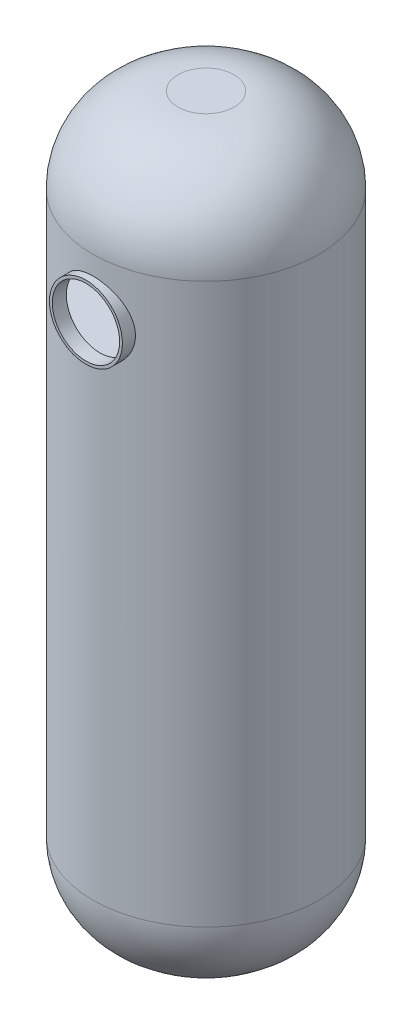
ISO-10303-21;
HEADER;
FILE_DESCRIPTION(('STEP AP214'),'2;1');
FILE_NAME('part.step','',(''),(''),'','','');
FILE_SCHEMA(('AUTOMOTIVE_DESIGN { 1 0 10303 214 1 1 1 1 }'));
ENDSEC;
DATA;
#1=APPLICATION_CONTEXT('core data for automotive mechanical design processes');
#2=APPLICATION_PROTOCOL_DEFINITION('international standard','automotive_design',2000,#1);
#3=PRODUCT_CONTEXT('',#1,'mechanical');
#4=PRODUCT('Part','Part','',(#3));
#5=PRODUCT_RELATED_PRODUCT_CATEGORY('part','',(#4));
#6=PRODUCT_DEFINITION_FORMATION('','',#4);
#7=PRODUCT_DEFINITION_CONTEXT('part definition',#1,'design');
#8=PRODUCT_DEFINITION('design','',#6,#7);
#9=PRODUCT_DEFINITION_SHAPE('','',#8);
#10=(LENGTH_UNIT() NAMED_UNIT(*) SI_UNIT(.MILLI.,.METRE.));
#11=(NAMED_UNIT(*) PLANE_ANGLE_UNIT() SI_UNIT($,.RADIAN.));
#12=(NAMED_UNIT(*) SI_UNIT($,.STERADIAN.) SOLID_ANGLE_UNIT());
#13=UNCERTAINTY_MEASURE_WITH_UNIT(LENGTH_MEASURE(1.E-05),#10,'distance_accuracy_value','');
#14=(GEOMETRIC_REPRESENTATION_CONTEXT(3) GLOBAL_UNCERTAINTY_ASSIGNED_CONTEXT((#13)) GLOBAL_UNIT_ASSIGNED_CONTEXT((#10,
#11,#12)) REPRESENTATION_CONTEXT('',''));
#15=CARTESIAN_POINT('',(0.,0.,0.));
#16=DIRECTION('',(0.,0.,1.));
#17=DIRECTION('',(1.,0.,0.));
#18=AXIS2_PLACEMENT_3D('',#15,#16,#17);
#19=CARTESIAN_POINT('',(0.,164.719,0.));
#20=DIRECTION('',(0.,1.,0.));
#21=DIRECTION('',(-1.,0.,0.));
#22=AXIS2_PLACEMENT_3D('',#19,#20,#21);
#23=CYLINDRICAL_SURFACE('',#22,50.8);
#24=CARTESIAN_POINT('',(0.,-75.2475,0.));
#25=DIRECTION('',(0.,1.,0.));
#26=DIRECTION('',(0.,0.,1.));
#27=AXIS2_PLACEMENT_3D('',#24,#25,#26);
#28=CIRCLE('',#27,50.8);
#29=CARTESIAN_POINT('',(0.,-75.2475,50.8));
#30=VERTEX_POINT('',#29);
#31=EDGE_CURVE('E263',#30,#30,#28,.T.);
#32=ORIENTED_EDGE('',*,*,#31,.T.);
#33=EDGE_LOOP('',(#32));
#34=FACE_BOUND('',#33,.T.);
#35=CARTESIAN_POINT('',(0.,-126.619,0.));
#36=DIRECTION('',(0.,1.,0.));
#37=DIRECTION('',(-1.,0.,0.));
#38=AXIS2_PLACEMENT_3D('',#35,#36,#37);
#39=CIRCLE('',#38,50.8);
#40=CARTESIAN_POINT('',(-50.8,-126.619,0.));
#41=VERTEX_POINT('',#40);
#42=EDGE_CURVE('E205',#41,#41,#39,.T.);
#43=ORIENTED_EDGE('',*,*,#42,.F.);
#44=EDGE_LOOP('',(#43));
#45=FACE_BOUND('',#44,.T.);
#46=CARTESIAN_POINT('',(16.51,-101.6,-48.0422720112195));
#47=CARTESIAN_POINT('',(16.5099998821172,-102.050346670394,-48.0422721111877));
#48=CARTESIAN_POINT('',(16.4915583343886,-102.500695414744,-48.0486214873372));
#49=CARTESIAN_POINT('',(16.4179735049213,-103.398029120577,-48.0738145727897));
#50=CARTESIAN_POINT('',(16.3628299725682,-103.84501405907,-48.0926583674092));
#51=CARTESIAN_POINT('',(16.216360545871,-104.732415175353,-48.1422435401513));
#52=CARTESIAN_POINT('',(16.1250285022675,-105.172830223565,-48.1729869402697));
#53=CARTESIAN_POINT('',(15.9070258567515,-106.043895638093,-48.2454111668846));
#54=CARTESIAN_POINT('',(15.7803550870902,-106.474545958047,-48.2870920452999));
#55=CARTESIAN_POINT('',(15.493054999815,-107.322350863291,-48.3800369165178));
#56=CARTESIAN_POINT('',(15.332491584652,-107.73952985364,-48.4312822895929));
#57=CARTESIAN_POINT('',(14.9785550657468,-108.558594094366,-48.5419122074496));
#58=CARTESIAN_POINT('',(14.7851820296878,-108.96047937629,-48.6012967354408));
#59=CARTESIAN_POINT('',(14.3670353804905,-109.74657128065,-48.7265421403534));
#60=CARTESIAN_POINT('',(14.1422575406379,-110.130775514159,-48.7924038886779));
#61=CARTESIAN_POINT('',(13.6628532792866,-110.87922763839,-48.9288108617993));
#62=CARTESIAN_POINT('',(13.4082250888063,-111.243474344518,-48.9993563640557));
#63=CARTESIAN_POINT('',(12.8616800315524,-111.961842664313,-49.145700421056));
#64=CARTESIAN_POINT('',(12.5687951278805,-112.315208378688,-49.22159590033));
#65=CARTESIAN_POINT('',(11.9547503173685,-112.996239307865,-49.3743255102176));
#66=CARTESIAN_POINT('',(11.6335898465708,-113.323904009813,-49.4511596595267));
#67=CARTESIAN_POINT('',(10.9649205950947,-113.95155498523,-49.6037106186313));
#68=CARTESIAN_POINT('',(10.6174074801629,-114.251536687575,-49.6794272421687));
#69=CARTESIAN_POINT('',(9.89820314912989,-114.821810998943,-49.827706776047));
#70=CARTESIAN_POINT('',(9.52651265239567,-115.092104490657,-49.9002697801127));
#71=CARTESIAN_POINT('',(8.75173304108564,-115.607463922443,-50.042042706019));
#72=CARTESIAN_POINT('',(8.34809451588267,-115.851739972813,-50.111125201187));
#73=CARTESIAN_POINT('',(7.52045662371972,-116.305288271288,-50.2419967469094));
#74=CARTESIAN_POINT('',(7.09645682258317,-116.514559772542,-50.3037856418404));
#75=CARTESIAN_POINT('',(6.23110981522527,-116.896305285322,-50.4182872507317));
#76=CARTESIAN_POINT('',(5.78976605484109,-117.068786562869,-50.471001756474));
#77=CARTESIAN_POINT('',(4.89285970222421,-117.375443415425,-50.5658306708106));
#78=CARTESIAN_POINT('',(4.43729768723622,-117.509620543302,-50.6079455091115));
#79=CARTESIAN_POINT('',(3.53072752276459,-117.734586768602,-50.6791257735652));
#80=CARTESIAN_POINT('',(3.0800703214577,-117.826668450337,-50.7085780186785));
#81=CARTESIAN_POINT('',(2.17203433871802,-117.972960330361,-50.7555801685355));
#82=CARTESIAN_POINT('',(1.71465569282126,-118.027171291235,-50.773130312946));
#83=CARTESIAN_POINT('',(0.796757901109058,-118.097184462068,-50.7958255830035));
#84=CARTESIAN_POINT('',(0.33623943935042,-118.11299478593,-50.8009733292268));
#85=CARTESIAN_POINT('',(-0.58447182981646,-118.10607214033,-50.7987234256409));
#86=CARTESIAN_POINT('',(-1.04466464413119,-118.083340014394,-50.7913260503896));
#87=CARTESIAN_POINT('',(-1.94403652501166,-118.001129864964,-50.7647075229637));
#88=CARTESIAN_POINT('',(-2.38335826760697,-117.943056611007,-50.7459385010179));
#89=CARTESIAN_POINT('',(-3.25531642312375,-117.791936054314,-50.6974710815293));
#90=CARTESIAN_POINT('',(-3.68795303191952,-117.698889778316,-50.6677730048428));
#91=CARTESIAN_POINT('',(-4.54361091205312,-117.478629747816,-50.598220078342));
#92=CARTESIAN_POINT('',(-4.96663182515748,-117.351414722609,-50.5583648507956));
#93=CARTESIAN_POINT('',(-5.8002753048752,-117.06387177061,-50.4695209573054));
#94=CARTESIAN_POINT('',(-6.21089760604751,-116.903543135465,-50.4205320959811));
#95=CARTESIAN_POINT('',(-7.02231172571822,-116.548772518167,-50.3139813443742));
#96=CARTESIAN_POINT('',(-7.42291117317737,-116.353921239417,-50.2563180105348));
#97=CARTESIAN_POINT('',(-8.2062858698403,-115.932993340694,-50.1343598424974));
#98=CARTESIAN_POINT('',(-8.58906105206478,-115.706916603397,-50.0700649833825));
#99=CARTESIAN_POINT('',(-9.33461255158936,-115.225056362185,-49.9364444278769));
#100=CARTESIAN_POINT('',(-9.69738470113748,-114.969266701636,-49.8671176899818));
#101=CARTESIAN_POINT('',(-10.4007841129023,-114.429664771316,-49.7251692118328));
#102=CARTESIAN_POINT('',(-10.7414101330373,-114.145850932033,-49.6525472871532));
#103=CARTESIAN_POINT('',(-11.4133410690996,-113.53858889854,-49.5025192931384));
#104=CARTESIAN_POINT('',(-11.7435403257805,-113.213933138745,-49.4250448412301));
#105=CARTESIAN_POINT('',(-12.3755765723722,-112.537975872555,-49.2705893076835));
#106=CARTESIAN_POINT('',(-12.6774127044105,-112.186673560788,-49.1936082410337));
#107=CARTESIAN_POINT('',(-13.2508105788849,-111.459539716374,-49.0422672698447));
#108=CARTESIAN_POINT('',(-13.5223673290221,-111.083704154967,-48.9679077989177));
#109=CARTESIAN_POINT('',(-14.0332725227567,-110.309896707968,-48.8239462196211));
#110=CARTESIAN_POINT('',(-14.2726223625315,-109.911925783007,-48.754343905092));
#111=CARTESIAN_POINT('',(-14.7202631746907,-109.091017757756,-48.6210770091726));
#112=CARTESIAN_POINT('',(-14.9281082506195,-108.667822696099,-48.5575017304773));
#113=CARTESIAN_POINT('',(-15.3072307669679,-107.804127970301,-48.4393243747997));
#114=CARTESIAN_POINT('',(-15.4785076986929,-107.363628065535,-48.3847224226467));
#115=CARTESIAN_POINT('',(-15.7829040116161,-106.468612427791,-48.2862873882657));
#116=CARTESIAN_POINT('',(-15.9160357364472,-106.014101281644,-48.2424508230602));
#117=CARTESIAN_POINT('',(-16.1429193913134,-105.094362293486,-48.1670061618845));
#118=CARTESIAN_POINT('',(-16.2366732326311,-104.629134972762,-48.1353974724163));
#119=CARTESIAN_POINT('',(-16.3806665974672,-103.711872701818,-48.0865810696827));
#120=CARTESIAN_POINT('',(-16.4326088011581,-103.260134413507,-48.068810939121));
#121=CARTESIAN_POINT('',(-16.4990524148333,-102.353594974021,-48.0460458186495));
#122=CARTESIAN_POINT('',(-16.5135548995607,-101.898793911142,-48.0410504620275));
#123=CARTESIAN_POINT('',(-16.5049753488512,-100.98966116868,-48.0439986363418));
#124=CARTESIAN_POINT('',(-16.4818990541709,-100.53532942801,-48.051940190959));
#125=CARTESIAN_POINT('',(-16.3984039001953,-99.6305186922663,-48.0804980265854));
#126=CARTESIAN_POINT('',(-16.3379854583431,-99.1800396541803,-48.1011141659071));
#127=CARTESIAN_POINT('',(-16.1829368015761,-98.3006748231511,-48.1534941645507));
#128=CARTESIAN_POINT('',(-16.0894694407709,-97.871560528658,-48.184878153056));
#129=CARTESIAN_POINT('',(-15.8689350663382,-97.0229725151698,-48.2579566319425));
#130=CARTESIAN_POINT('',(-15.7418689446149,-96.6034985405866,-48.2996508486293));
#131=CARTESIAN_POINT('',(-15.4551651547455,-95.776822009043,-48.3921536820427));
#132=CARTESIAN_POINT('',(-15.2955233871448,-95.3696210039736,-48.4429634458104));
#133=CARTESIAN_POINT('',(-14.944899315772,-94.5700156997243,-48.5522778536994));
#134=CARTESIAN_POINT('',(-14.7539160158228,-94.1776118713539,-48.6107827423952));
#135=CARTESIAN_POINT('',(-14.3356774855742,-93.398172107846,-48.7357918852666));
#136=CARTESIAN_POINT('',(-14.1074937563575,-93.0116647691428,-48.8024856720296));
#137=CARTESIAN_POINT('',(-13.620869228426,-92.2590774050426,-48.9405339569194));
#138=CARTESIAN_POINT('',(-13.3624279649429,-91.89299769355,-49.0118885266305));
#139=CARTESIAN_POINT('',(-12.8168922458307,-91.1832950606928,-49.1573693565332));
#140=CARTESIAN_POINT('',(-12.5297908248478,-90.8396776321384,-49.2314962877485));
#141=CARTESIAN_POINT('',(-11.9287374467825,-90.1769773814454,-49.3805739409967));
#142=CARTESIAN_POINT('',(-11.614784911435,-89.857895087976,-49.4555246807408));
#143=CARTESIAN_POINT('',(-10.9470269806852,-89.2322427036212,-49.6077120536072));
#144=CARTESIAN_POINT('',(-10.592059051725,-88.9268995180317,-49.6848978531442));
#145=CARTESIAN_POINT('',(-9.85702173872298,-88.34713869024,-49.8359295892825));
#146=CARTESIAN_POINT('',(-9.47695154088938,-88.0727220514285,-49.9097754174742));
#147=CARTESIAN_POINT('',(-8.69413801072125,-87.5567882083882,-50.0520748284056));
#148=CARTESIAN_POINT('',(-8.29139491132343,-87.315270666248,-50.1205284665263));
#149=CARTESIAN_POINT('',(-7.46587857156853,-86.8669979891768,-50.2501262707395));
#150=CARTESIAN_POINT('',(-7.04310575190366,-86.6602421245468,-50.3112705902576));
#151=CARTESIAN_POINT('',(-6.18342006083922,-86.284519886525,-50.4241205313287));
#152=CARTESIAN_POINT('',(-5.74662610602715,-86.1153004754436,-50.4758888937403));
#153=CARTESIAN_POINT('',(-4.85922357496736,-85.8143245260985,-50.5690315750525));
#154=CARTESIAN_POINT('',(-4.40861499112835,-85.6825680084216,-50.6104058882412));
#155=CARTESIAN_POINT('',(-3.49706679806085,-85.4577907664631,-50.6815493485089));
#156=CARTESIAN_POINT('',(-3.03613014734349,-85.3647590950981,-50.71132177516));
#157=CARTESIAN_POINT('',(-2.10738252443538,-85.2183024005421,-50.7583992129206));
#158=CARTESIAN_POINT('',(-1.63957183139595,-85.1648757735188,-50.775704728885));
#159=CARTESIAN_POINT('',(-0.721875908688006,-85.0996660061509,-50.7968506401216));
#160=CARTESIAN_POINT('',(-0.272128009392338,-85.0861222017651,-50.8012602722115));
#161=CARTESIAN_POINT('',(0.626922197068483,-85.0957839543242,-50.7981202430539));
#162=CARTESIAN_POINT('',(1.07622451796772,-85.1189883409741,-50.7905709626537));
#163=CARTESIAN_POINT('',(1.97105048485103,-85.2019223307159,-50.7637205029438));
#164=CARTESIAN_POINT('',(2.41657441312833,-85.2616491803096,-50.7444202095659));
#165=CARTESIAN_POINT('',(3.30066128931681,-85.4170713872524,-50.6945920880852));
#166=CARTESIAN_POINT('',(3.7392242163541,-85.512766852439,-50.664064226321));
#167=CARTESIAN_POINT('',(4.60000796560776,-85.7376220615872,-50.5931194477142));
#168=CARTESIAN_POINT('',(5.02237361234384,-85.8662757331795,-50.5528525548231));
#169=CARTESIAN_POINT('',(5.85458586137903,-86.1566148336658,-50.4632439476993));
#170=CARTESIAN_POINT('',(6.26443264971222,-86.31829977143,-50.413902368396));
#171=CARTESIAN_POINT('',(7.06909722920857,-86.6734665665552,-50.307381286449));
#172=CARTESIAN_POINT('',(7.4639132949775,-86.8669520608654,-50.2502008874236));
#173=CARTESIAN_POINT('',(8.23613169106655,-87.2843132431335,-50.1294214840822));
#174=CARTESIAN_POINT('',(8.61353292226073,-87.5081908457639,-50.0658220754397));
#175=CARTESIAN_POINT('',(9.36188783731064,-87.993345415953,-49.9314000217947));
#176=CARTESIAN_POINT('',(9.73212866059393,-88.2556732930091,-49.8604004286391));
#177=CARTESIAN_POINT('',(10.4493729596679,-88.8095339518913,-49.7150332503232));
#178=CARTESIAN_POINT('',(10.7963759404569,-89.1010673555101,-49.6406655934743));
#179=CARTESIAN_POINT('',(11.4651895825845,-89.7115773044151,-49.490473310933));
#180=CARTESIAN_POINT('',(11.7869927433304,-90.0305619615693,-49.4146482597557));
#181=CARTESIAN_POINT('',(12.4033582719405,-90.6939554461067,-49.2635505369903));
#182=CARTESIAN_POINT('',(12.697920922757,-91.0383640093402,-49.188277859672));
#183=CARTESIAN_POINT('',(13.2682818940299,-91.7636707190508,-49.0375661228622));
#184=CARTESIAN_POINT('',(13.5429931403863,-92.1454446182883,-48.9622225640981));
#185=CARTESIAN_POINT('',(14.0592410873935,-92.9317226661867,-48.8164901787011));
#186=CARTESIAN_POINT('',(14.3007765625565,-93.3362276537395,-48.7461015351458));
#187=CARTESIAN_POINT('',(14.7487632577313,-94.1652171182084,-48.6124329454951));
#188=CARTESIAN_POINT('',(14.95522361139,-94.5896963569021,-48.5491511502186));
#189=CARTESIAN_POINT('',(15.3314129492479,-95.4558349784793,-48.4316698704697));
#190=CARTESIAN_POINT('',(15.5011443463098,-95.8974932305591,-48.3774697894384));
#191=CARTESIAN_POINT('',(15.7930794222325,-96.7671944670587,-48.282923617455));
#192=CARTESIAN_POINT('',(15.9175656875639,-97.1944018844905,-48.2419300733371));
#193=CARTESIAN_POINT('',(16.1317894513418,-98.0583196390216,-48.1707186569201));
#194=CARTESIAN_POINT('',(16.2215286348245,-98.4950295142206,-48.140500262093));
#195=CARTESIAN_POINT('',(16.3654285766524,-99.3748091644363,-48.0917719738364));
#196=CARTESIAN_POINT('',(16.4195984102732,-99.8178772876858,-48.0732590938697));
#197=CARTESIAN_POINT('',(16.4918844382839,-100.707296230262,-48.0485089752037));
#198=CARTESIAN_POINT('',(16.5100001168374,-101.153647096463,-48.0422719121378));
#199=CARTESIAN_POINT('',(16.51,-101.6,-48.0422720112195));
#200=B_SPLINE_CURVE_WITH_KNOTS('',3,(#46,#47,#48,#49,#50,#51,#52,#53,#54,#55,#56,#57,#58,#59,
#60,#61,#62,#63,#64,#65,#66,#67,#68,#69,#70,#71,#72,#73,#74,#75,#76,#77,#78,#79,#80,#81,#82,#83,
#84,#85,#86,#87,#88,#89,#90,#91,#92,#93,#94,#95,#96,#97,#98,#99,#100,#101,#102,#103,#104,#105,
#106,#107,#108,#109,#110,#111,#112,#113,#114,#115,#116,#117,#118,#119,#120,#121,#122,#123,#124,
#125,#126,#127,#128,#129,#130,#131,#132,#133,#134,#135,#136,#137,#138,#139,#140,#141,#142,#143,
#144,#145,#146,#147,#148,#149,#150,#151,#152,#153,#154,#155,#156,#157,#158,#159,#160,#161,#162,
#163,#164,#165,#166,#167,#168,#169,#170,#171,#172,#173,#174,#175,#176,#177,#178,#179,#180,#181,
#182,#183,#184,#185,#186,#187,#188,#189,#190,#191,#192,#193,#194,#195,#196,#197,#198,#199),
.UNSPECIFIED.,.T.,.F.,(4,2,2,2,2,2,2,2,2,2,2,2,2,2,2,2,2,2,2,2,2,2,2,2,2,2,2,2,2,2,2,2,2,2,2,2,
2,2,2,2,2,2,2,2,2,2,2,2,2,2,2,2,2,2,2,2,2,2,2,2,2,2,2,2,2,2,2,2,2,2,2,2,2,2,2,2,4),(0.,
1.35062360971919,2.70125644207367,4.05211887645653,5.40298772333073,6.75125368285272,
8.09951686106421,9.44796167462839,10.7964864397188,12.1904958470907,13.5845330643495,
14.9788000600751,16.3730255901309,17.8017558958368,19.2305166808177,20.6589950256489,
22.0874154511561,23.4684124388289,24.8493816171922,26.2300589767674,27.6107061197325,
28.9397646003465,30.2687840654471,31.5978529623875,32.9269502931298,34.2730119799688,
35.6190787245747,36.9654248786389,38.3118464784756,39.7187371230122,41.1256703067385,
42.5328351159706,43.9399389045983,45.3653984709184,46.7908778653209,48.2158954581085,
49.6408438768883,51.0043218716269,52.3677607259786,53.7309913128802,55.0942066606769,
56.4135768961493,57.7329121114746,59.0524134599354,60.371956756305,61.7317390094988,
63.0915421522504,64.4516765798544,65.811840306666,67.2337938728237,68.6557935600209,
70.077778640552,71.4997338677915,72.911790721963,74.3238483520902,75.7355065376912,
77.1471075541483,78.4953820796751,79.8436136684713,81.1917436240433,82.5398776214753,
83.8684368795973,85.1969763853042,86.5256679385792,87.8544432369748,89.2307229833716,
90.6070320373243,91.9837491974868,93.3604520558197,94.7877371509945,96.2150749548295,
97.6420405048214,99.0689122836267,100.407945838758,101.746914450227,103.08554130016,
104.424187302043),.UNSPECIFIED.);
#201=CARTESIAN_POINT('',(16.51,-101.6,-48.0422720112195));
#202=VERTEX_POINT('',#201);
#203=EDGE_CURVE('E121',#202,#202,#200,.T.);
#204=ORIENTED_EDGE('',*,*,#203,.T.);
#205=EDGE_LOOP('',(#204));
#206=FACE_BOUND('',#205,.T.);
#207=ADVANCED_FACE('F43',(#34,#45,#206),#23,.F.);
#208=CARTESIAN_POINT('',(0.,164.719,0.));
#209=DIRECTION('',(0.,1.,0.));
#210=DIRECTION('',(-1.,0.,0.));
#211=AXIS2_PLACEMENT_3D('',#208,#209,#210);
#212=CYLINDRICAL_SURFACE('',#211,51.181);
#213=CARTESIAN_POINT('',(-16.51,101.6,48.4449652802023));
#214=CARTESIAN_POINT('',(-16.5099997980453,102.05054923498,48.4449654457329));
#215=CARTESIAN_POINT('',(-16.4915417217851,102.501101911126,48.4512676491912));
#216=CARTESIAN_POINT('',(-16.417889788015,103.398845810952,48.4762741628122));
#217=CARTESIAN_POINT('',(-16.362695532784,103.846036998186,48.4949786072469));
#218=CARTESIAN_POINT('',(-16.2160880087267,104.733857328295,48.5441985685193));
#219=CARTESIAN_POINT('',(-16.1246681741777,105.174485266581,48.5747162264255));
#220=CARTESIAN_POINT('',(-15.9064511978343,106.045975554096,48.6466108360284));
#221=CARTESIAN_POINT('',(-15.7796539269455,106.476837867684,48.6879878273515));
#222=CARTESIAN_POINT('',(-15.4920570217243,107.325072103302,48.7802589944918));
#223=CARTESIAN_POINT('',(-15.3313225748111,107.742468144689,48.8311349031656));
#224=CARTESIAN_POINT('',(-14.9770008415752,108.561955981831,48.9409704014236));
#225=CARTESIAN_POINT('',(-14.7834136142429,108.964047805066,48.9999299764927));
#226=CARTESIAN_POINT('',(-14.364796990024,109.750533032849,49.1242814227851));
#227=CARTESIAN_POINT('',(-14.1397634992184,110.134924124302,49.1896741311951));
#228=CARTESIAN_POINT('',(-13.6598082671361,110.883723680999,49.3251108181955));
#229=CARTESIAN_POINT('',(-13.4048847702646,111.248130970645,49.3951550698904));
#230=CARTESIAN_POINT('',(-12.8578403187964,111.966610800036,49.5404219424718));
#231=CARTESIAN_POINT('',(-12.5647649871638,112.319937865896,49.6157392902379));
#232=CARTESIAN_POINT('',(-11.9503355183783,113.000872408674,49.7673019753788));
#233=CARTESIAN_POINT('',(-11.6289808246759,113.32847937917,49.8435473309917));
#234=CARTESIAN_POINT('',(-10.9599257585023,113.955990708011,49.9949239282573));
#235=CARTESIAN_POINT('',(-10.6122211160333,114.255890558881,50.0700549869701));
#236=CARTESIAN_POINT('',(-9.89264221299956,114.825975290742,50.2171806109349));
#237=CARTESIAN_POINT('',(-9.52076866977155,115.096161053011,50.2891752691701));
#238=CARTESIAN_POINT('',(-8.74578959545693,115.611172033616,50.4298000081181));
#239=CARTESIAN_POINT('',(-8.34214415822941,115.855219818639,50.4983055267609));
#240=CARTESIAN_POINT('',(-7.51453049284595,116.308313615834,50.6280753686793));
#241=CARTESIAN_POINT('',(-7.09056183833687,116.517358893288,50.6893395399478));
#242=CARTESIAN_POINT('',(-6.22531540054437,116.89866025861,50.8028594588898));
#243=CARTESIAN_POINT('',(-5.78404100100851,117.070923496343,50.855116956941));
#244=CARTESIAN_POINT('',(-4.88731182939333,117.377158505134,50.949113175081));
#245=CARTESIAN_POINT('',(-4.43185762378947,117.511131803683,50.9908523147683));
#246=CARTESIAN_POINT('',(-3.52532325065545,117.735769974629,51.0614016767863));
#247=CARTESIAN_POINT('',(-3.07458817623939,117.827709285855,51.0905904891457));
#248=CARTESIAN_POINT('',(-2.16641821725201,117.973705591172,51.1371498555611));
#249=CARTESIAN_POINT('',(-1.7089834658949,118.027763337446,51.1545206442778));
#250=CARTESIAN_POINT('',(-0.790990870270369,118.097462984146,51.1769465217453));
#251=CARTESIAN_POINT('',(-0.330433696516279,118.113112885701,51.1820041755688));
#252=CARTESIAN_POINT('',(0.590340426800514,118.105864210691,51.1796658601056));
#253=CARTESIAN_POINT('',(1.05055738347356,118.082966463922,51.1722701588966));
#254=CARTESIAN_POINT('',(1.950217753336,118.000403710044,51.1457374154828));
#255=CARTESIAN_POINT('',(2.38980215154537,117.942123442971,51.1270426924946));
#256=CARTESIAN_POINT('',(3.26227025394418,117.790544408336,51.0787943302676));
#257=CARTESIAN_POINT('',(3.69515415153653,117.697246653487,51.0492410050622));
#258=CARTESIAN_POINT('',(4.5512884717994,117.476439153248,50.9800451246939));
#259=CARTESIAN_POINT('',(4.97453853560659,117.348928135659,50.9404021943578));
#260=CARTESIAN_POINT('',(5.80861827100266,117.060748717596,50.8520463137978));
#261=CARTESIAN_POINT('',(6.21944767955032,116.900079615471,50.8033331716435));
#262=CARTESIAN_POINT('',(7.03120948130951,116.544597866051,50.6974015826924));
#263=CARTESIAN_POINT('',(7.43195073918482,116.349378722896,50.6400832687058));
#264=CARTESIAN_POINT('',(8.21557894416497,115.927677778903,50.5188701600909));
#265=CARTESIAN_POINT('',(8.59846582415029,115.701195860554,50.4549753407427));
#266=CARTESIAN_POINT('',(9.34420314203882,115.218490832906,50.3222030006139));
#267=CARTESIAN_POINT('',(9.70704944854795,114.962261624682,50.2533244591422));
#268=CARTESIAN_POINT('',(10.4105531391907,114.421750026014,50.1123126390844));
#269=CARTESIAN_POINT('',(10.7512092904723,114.137466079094,50.0401791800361));
#270=CARTESIAN_POINT('',(11.4229425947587,113.529404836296,49.8912285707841));
#271=CARTESIAN_POINT('',(11.7529275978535,113.204436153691,49.8143454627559));
#272=CARTESIAN_POINT('',(12.3845072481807,112.52786597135,49.6610951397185));
#273=CARTESIAN_POINT('',(12.686101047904,112.176263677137,49.5847279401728));
#274=CARTESIAN_POINT('',(13.2589821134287,111.448551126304,49.434622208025));
#275=CARTESIAN_POINT('',(13.5302645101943,111.072436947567,49.3608840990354));
#276=CARTESIAN_POINT('',(14.0405893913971,110.298100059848,49.218155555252));
#277=CARTESIAN_POINT('',(14.2796332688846,109.899878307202,49.1491649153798));
#278=CARTESIAN_POINT('',(14.7265473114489,109.078648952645,49.0171253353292));
#279=CARTESIAN_POINT('',(14.9339836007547,108.655391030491,48.9541628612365));
#280=CARTESIAN_POINT('',(15.3122877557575,107.791626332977,48.8371563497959));
#281=CARTESIAN_POINT('',(15.4831551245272,107.35111932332,48.7831124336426));
#282=CARTESIAN_POINT('',(15.7867402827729,106.456144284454,48.6857168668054));
#283=CARTESIAN_POINT('',(15.9194701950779,106.001680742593,48.6423618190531));
#284=CARTESIAN_POINT('',(16.1455656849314,105.082092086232,48.5677843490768));
#285=CARTESIAN_POINT('',(16.2389331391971,104.616967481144,48.5365613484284));
#286=CARTESIAN_POINT('',(16.3822359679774,103.699684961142,48.4883755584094));
#287=CARTESIAN_POINT('',(16.4338508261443,103.247817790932,48.4708623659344));
#288=CARTESIAN_POINT('',(16.4996227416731,102.34105616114,48.4485132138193));
#289=CARTESIAN_POINT('',(16.5137808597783,101.886161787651,48.4436768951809));
#290=CARTESIAN_POINT('',(16.5044997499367,100.976872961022,48.4468396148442));
#291=CARTESIAN_POINT('',(16.4810661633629,100.522478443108,48.4548367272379));
#292=CARTESIAN_POINT('',(16.396845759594,99.6175693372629,48.4834010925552));
#293=CARTESIAN_POINT('',(16.336059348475,99.1670547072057,48.5039682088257));
#294=CARTESIAN_POINT('',(16.1802263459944,98.2873584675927,48.556168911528));
#295=CARTESIAN_POINT('',(16.0863203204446,97.8579520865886,48.5874331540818));
#296=CARTESIAN_POINT('',(15.8648550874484,97.0088138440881,48.6601962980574));
#297=CARTESIAN_POINT('',(15.737296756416,96.5890817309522,48.7016949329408));
#298=CARTESIAN_POINT('',(15.4495564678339,95.7619281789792,48.7937369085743));
#299=CARTESIAN_POINT('',(15.2893704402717,95.3545082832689,48.8442813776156));
#300=CARTESIAN_POINT('',(14.9376078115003,94.5545103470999,48.9530029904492));
#301=CARTESIAN_POINT('',(14.7460302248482,94.1619327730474,49.0111803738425));
#302=CARTESIAN_POINT('',(14.3266103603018,93.3823289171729,49.1354479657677));
#303=CARTESIAN_POINT('',(14.0978490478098,92.9958266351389,49.2017238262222));
#304=CARTESIAN_POINT('',(13.6100451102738,92.2432991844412,49.3388852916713));
#305=CARTESIAN_POINT('',(13.3510020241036,91.87727432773,49.409770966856));
#306=CARTESIAN_POINT('',(12.8042447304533,91.1677395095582,49.5542735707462));
#307=CARTESIAN_POINT('',(12.5165236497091,90.8242349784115,49.6278911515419));
#308=CARTESIAN_POINT('',(11.914219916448,90.1618241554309,49.7759207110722));
#309=CARTESIAN_POINT('',(11.5996366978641,89.8429183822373,49.8503327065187));
#310=CARTESIAN_POINT('',(10.9308414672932,89.2179359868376,50.0013413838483));
#311=CARTESIAN_POINT('',(10.5754871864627,88.9130679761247,50.0778872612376));
#312=CARTESIAN_POINT('',(9.83972294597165,88.3342906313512,50.2276372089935));
#313=CARTESIAN_POINT('',(9.45931218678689,88.060382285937,50.3008411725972));
#314=CARTESIAN_POINT('',(8.67587133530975,87.5454966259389,50.4418715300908));
#315=CARTESIAN_POINT('',(8.27284150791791,87.3045189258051,50.5096979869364));
#316=CARTESIAN_POINT('',(7.44681199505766,86.8573527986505,50.6380728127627));
#317=CARTESIAN_POINT('',(7.02381272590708,86.6511636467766,50.6986213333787));
#318=CARTESIAN_POINT('',(6.1637807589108,86.2766083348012,50.8103262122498));
#319=CARTESIAN_POINT('',(5.72686806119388,86.107985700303,50.8615457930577));
#320=CARTESIAN_POINT('',(4.83929868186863,85.8082082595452,50.9536552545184));
#321=CARTESIAN_POINT('',(4.38864199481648,85.6770534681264,50.9945451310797));
#322=CARTESIAN_POINT('',(3.47706546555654,85.4534743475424,51.0647988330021));
#323=CARTESIAN_POINT('',(3.01614851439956,85.361039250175,51.0941658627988));
#324=CARTESIAN_POINT('',(2.08750616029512,85.2157618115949,51.1405237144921));
#325=CARTESIAN_POINT('',(1.61978102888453,85.162917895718,51.1575150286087));
#326=CARTESIAN_POINT('',(0.702016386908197,85.0988051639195,51.1781519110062));
#327=CARTESIAN_POINT('',(0.252109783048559,85.0858006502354,51.1823545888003));
#328=CARTESIAN_POINT('',(-0.647208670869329,85.0965632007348,51.1788829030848));
#329=CARTESIAN_POINT('',(-1.09662053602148,85.120329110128,51.1712089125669));
#330=CARTESIAN_POINT('',(-1.99161926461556,85.2044039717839,51.144194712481));
#331=CARTESIAN_POINT('',(-2.43720640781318,85.2647102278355,51.124855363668));
#332=CARTESIAN_POINT('',(-3.32137506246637,85.4213060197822,51.0750359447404));
#333=CARTESIAN_POINT('',(-3.75995655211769,85.5175956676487,51.0445558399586));
#334=CARTESIAN_POINT('',(-4.62090637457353,85.7436883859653,50.9737769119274));
#335=CARTESIAN_POINT('',(-5.04341621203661,85.8729988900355,50.9336228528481));
#336=CARTESIAN_POINT('',(-5.87586509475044,86.1646890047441,50.8443135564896));
#337=CARTESIAN_POINT('',(-6.28580432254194,86.3270681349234,50.7951584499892));
#338=CARTESIAN_POINT('',(-7.0905982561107,86.683658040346,50.6890812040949));
#339=CARTESIAN_POINT('',(-7.48545123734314,86.8778724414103,50.6321581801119));
#340=CARTESIAN_POINT('',(-8.25768332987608,87.2967229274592,50.5119605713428));
#341=CARTESIAN_POINT('',(-8.63506134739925,87.5213609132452,50.4486855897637));
#342=CARTESIAN_POINT('',(-9.38317325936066,88.0080073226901,50.315010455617));
#343=CARTESIAN_POINT('',(-9.75319904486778,88.271057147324,50.2444373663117));
#344=CARTESIAN_POINT('',(-10.4699524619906,88.826365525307,50.0999854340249));
#345=CARTESIAN_POINT('',(-10.8166795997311,89.1186246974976,50.0261065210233));
#346=CARTESIAN_POINT('',(-11.4848748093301,89.7305833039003,49.8769450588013));
#347=CARTESIAN_POINT('',(-11.8063354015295,90.0502908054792,49.8016621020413));
#348=CARTESIAN_POINT('',(-12.4219445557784,90.7151187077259,49.6516912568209));
#349=CARTESIAN_POINT('',(-12.7160934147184,91.0602388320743,49.5770033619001));
#350=CARTESIAN_POINT('',(-13.2853383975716,91.7867218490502,49.4275657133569));
#351=CARTESIAN_POINT('',(-13.5593658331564,92.1689426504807,49.3529107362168));
#352=CARTESIAN_POINT('',(-14.0742092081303,92.956048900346,49.2085653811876));
#353=CARTESIAN_POINT('',(-14.315023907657,93.3609351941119,49.1388751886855));
#354=CARTESIAN_POINT('',(-14.7615323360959,94.1906055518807,49.0065929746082));
#355=CARTESIAN_POINT('',(-14.9672357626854,94.6153840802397,48.9439989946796));
#356=CARTESIAN_POINT('',(-15.3418854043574,95.4820370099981,48.8278590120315));
#357=CARTESIAN_POINT('',(-15.5108341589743,95.9239102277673,48.7743123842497));
#358=CARTESIAN_POINT('',(-15.8005375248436,96.791845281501,48.6812013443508));
#359=CARTESIAN_POINT('',(-15.9237428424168,97.2170162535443,48.6409457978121));
#360=CARTESIAN_POINT('',(-16.1357500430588,98.0767004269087,48.5710285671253));
#361=CARTESIAN_POINT('',(-16.2245537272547,98.5112131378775,48.5413663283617));
#362=CARTESIAN_POINT('',(-16.3669493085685,99.3864920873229,48.4935396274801));
#363=CARTESIAN_POINT('',(-16.4205498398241,99.8272567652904,48.4753723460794));
#364=CARTESIAN_POINT('',(-16.492075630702,100.712013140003,48.4510849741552));
#365=CARTESIAN_POINT('',(-16.5100001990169,101.156004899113,48.4449651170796));
#366=CARTESIAN_POINT('',(-16.51,101.6,48.4449652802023));
#367=B_SPLINE_CURVE_WITH_KNOTS('',3,(#213,#214,#215,#216,#217,#218,#219,#220,#221,#222,#223,
#224,#225,#226,#227,#228,#229,#230,#231,#232,#233,#234,#235,#236,#237,#238,#239,#240,#241,#242,
#243,#244,#245,#246,#247,#248,#249,#250,#251,#252,#253,#254,#255,#256,#257,#258,#259,#260,#261,
#262,#263,#264,#265,#266,#267,#268,#269,#270,#271,#272,#273,#274,#275,#276,#277,#278,#279,#280,
#281,#282,#283,#284,#285,#286,#287,#288,#289,#290,#291,#292,#293,#294,#295,#296,#297,#298,#299,
#300,#301,#302,#303,#304,#305,#306,#307,#308,#309,#310,#311,#312,#313,#314,#315,#316,#317,#318,
#319,#320,#321,#322,#323,#324,#325,#326,#327,#328,#329,#330,#331,#332,#333,#334,#335,#336,#337,
#338,#339,#340,#341,#342,#343,#344,#345,#346,#347,#348,#349,#350,#351,#352,#353,#354,#355,#356,
#357,#358,#359,#360,#361,#362,#363,#364,#365,#366),.UNSPECIFIED.,.T.,.F.,(4,2,2,2,2,2,2,2,2,2,2,
2,2,2,2,2,2,2,2,2,2,2,2,2,2,2,2,2,2,2,2,2,2,2,2,2,2,2,2,2,2,2,2,2,2,2,2,2,2,2,2,2,2,2,2,2,2,2,2,
2,2,2,2,2,2,2,2,2,2,2,2,2,2,2,2,2,4),(0.,1.35123382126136,2.70248227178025,4.05397574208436,
5.40547414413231,6.75439979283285,8.10332301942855,9.45242202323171,10.8016003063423,
12.1955984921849,13.5896241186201,14.9838761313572,16.378086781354,17.806235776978,
19.2344147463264,20.6623158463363,22.090159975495,23.4712511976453,24.8523149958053,
26.2330910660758,27.6138374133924,28.9437473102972,30.2736187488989,31.6035396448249,
32.9334886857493,34.2802744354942,35.6270652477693,36.9741326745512,38.3212748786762,
39.7280706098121,41.1349083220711,42.5419716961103,43.9489742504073,45.373823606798,
46.79869232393,48.2231076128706,49.6474549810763,51.0111766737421,52.3748597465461,
53.7383381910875,55.1018018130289,56.4222785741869,57.7427209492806,59.0633281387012,
60.3839767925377,61.7444324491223,63.1049088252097,64.4657120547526,65.8265439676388,
67.2481374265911,68.6697762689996,70.0913984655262,71.5129910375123,72.9245585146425,
74.3361265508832,75.7473017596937,77.1584208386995,78.507118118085,79.85577304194,
81.2043284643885,82.5528880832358,83.8824001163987,85.2118928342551,86.5415370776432,
87.8712644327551,89.2480638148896,90.6248923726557,92.0021269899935,93.3793466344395,
94.8062000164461,96.2331066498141,97.6596185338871,99.0860318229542,100.417979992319,
101.749858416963,103.08141005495,104.412987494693),.UNSPECIFIED.);
#368=CARTESIAN_POINT('',(-16.51,101.6,48.4449652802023));
#369=VERTEX_POINT('',#368);
#370=EDGE_CURVE('E67',#369,#369,#367,.T.);
#371=ORIENTED_EDGE('',*,*,#370,.T.);
#372=EDGE_LOOP('',(#371));
#373=FACE_BOUND('',#372,.T.);
#374=CARTESIAN_POINT('',(0.,-126.619,0.));
#375=DIRECTION('',(0.,1.,0.));
#376=DIRECTION('',(-1.,0.,0.));
#377=AXIS2_PLACEMENT_3D('',#374,#375,#376);
#378=CIRCLE('',#377,51.181);
#379=CARTESIAN_POINT('',(-51.181,-126.619,0.));
#380=VERTEX_POINT('',#379);
#381=EDGE_CURVE('E223',#380,#380,#378,.T.);
#382=ORIENTED_EDGE('',*,*,#381,.T.);
#383=EDGE_LOOP('',(#382));
#384=FACE_BOUND('',#383,.T.);
#385=CARTESIAN_POINT('',(0.,126.619,0.));
#386=DIRECTION('',(0.,1.,0.));
#387=DIRECTION('',(-1.,0.,0.));
#388=AXIS2_PLACEMENT_3D('',#385,#386,#387);
#389=CIRCLE('',#388,51.181);
#390=CARTESIAN_POINT('',(-51.181,126.619,0.));
#391=VERTEX_POINT('',#390);
#392=EDGE_CURVE('E227',#391,#391,#389,.T.);
#393=ORIENTED_EDGE('',*,*,#392,.F.);
#394=EDGE_LOOP('',(#393));
#395=FACE_BOUND('',#394,.T.);
#396=CARTESIAN_POINT('',(16.51,-101.6,-48.4449652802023));
#397=CARTESIAN_POINT('',(16.5099997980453,-101.14945076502,-48.4449654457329));
#398=CARTESIAN_POINT('',(16.4915417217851,-100.698898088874,-48.4512676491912));
#399=CARTESIAN_POINT('',(16.417889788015,-99.8011541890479,-48.4762741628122));
#400=CARTESIAN_POINT('',(16.362695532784,-99.3539630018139,-48.4949786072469));
#401=CARTESIAN_POINT('',(16.2160880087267,-98.4661426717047,-48.5441985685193));
#402=CARTESIAN_POINT('',(16.1246681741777,-98.0255147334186,-48.5747162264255));
#403=CARTESIAN_POINT('',(15.9064511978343,-97.1540244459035,-48.6466108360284));
#404=CARTESIAN_POINT('',(15.7796539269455,-96.7231621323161,-48.6879878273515));
#405=CARTESIAN_POINT('',(15.4920570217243,-95.8749278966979,-48.7802589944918));
#406=CARTESIAN_POINT('',(15.3313225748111,-95.4575318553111,-48.8311349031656));
#407=CARTESIAN_POINT('',(14.9770008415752,-94.6380440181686,-48.9409704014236));
#408=CARTESIAN_POINT('',(14.7834136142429,-94.2359521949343,-48.9999299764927));
#409=CARTESIAN_POINT('',(14.364796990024,-93.4494669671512,-49.1242814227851));
#410=CARTESIAN_POINT('',(14.1397634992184,-93.0650758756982,-49.1896741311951));
#411=CARTESIAN_POINT('',(13.6598082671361,-92.3162763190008,-49.3251108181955));
#412=CARTESIAN_POINT('',(13.4048847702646,-91.9518690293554,-49.3951550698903));
#413=CARTESIAN_POINT('',(12.8578403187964,-91.2333891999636,-49.5404219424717));
#414=CARTESIAN_POINT('',(12.5647649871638,-90.8800621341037,-49.6157392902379));
#415=CARTESIAN_POINT('',(11.9503355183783,-90.1991275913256,-49.7673019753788));
#416=CARTESIAN_POINT('',(11.6289808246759,-89.8715206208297,-49.8435473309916));
#417=CARTESIAN_POINT('',(10.9599257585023,-89.2440092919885,-49.9949239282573));
#418=CARTESIAN_POINT('',(10.6122211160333,-88.9441094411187,-50.0700549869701));
#419=CARTESIAN_POINT('',(9.89264221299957,-88.3740247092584,-50.2171806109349));
#420=CARTESIAN_POINT('',(9.52076866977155,-88.1038389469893,-50.2891752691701));
#421=CARTESIAN_POINT('',(8.74578959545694,-87.5888279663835,-50.4298000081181));
#422=CARTESIAN_POINT('',(8.34214415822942,-87.344780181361,-50.4983055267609));
#423=CARTESIAN_POINT('',(7.51453049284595,-86.8916863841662,-50.6280753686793));
#424=CARTESIAN_POINT('',(7.09056183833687,-86.6826411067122,-50.6893395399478));
#425=CARTESIAN_POINT('',(6.22531540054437,-86.3013397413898,-50.8028594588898));
#426=CARTESIAN_POINT('',(5.78404100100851,-86.1290765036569,-50.855116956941));
#427=CARTESIAN_POINT('',(4.88731182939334,-85.8228414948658,-50.949113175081));
#428=CARTESIAN_POINT('',(4.43185762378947,-85.6888681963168,-50.9908523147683));
#429=CARTESIAN_POINT('',(3.52532325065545,-85.4642300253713,-51.0614016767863));
#430=CARTESIAN_POINT('',(3.07458817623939,-85.3722907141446,-51.0905904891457));
#431=CARTESIAN_POINT('',(2.16641821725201,-85.2262944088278,-51.1371498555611));
#432=CARTESIAN_POINT('',(1.7089834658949,-85.172236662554,-51.1545206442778));
#433=CARTESIAN_POINT('',(0.790990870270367,-85.1025370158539,-51.1769465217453));
#434=CARTESIAN_POINT('',(0.330433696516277,-85.0868871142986,-51.1820041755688));
#435=CARTESIAN_POINT('',(-0.590340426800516,-85.0941357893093,-51.1796658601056));
#436=CARTESIAN_POINT('',(-1.05055738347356,-85.1170335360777,-51.1722701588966));
#437=CARTESIAN_POINT('',(-1.95021775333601,-85.1995962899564,-51.1457374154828));
#438=CARTESIAN_POINT('',(-2.38980215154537,-85.2578765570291,-51.1270426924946));
#439=CARTESIAN_POINT('',(-3.26227025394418,-85.409455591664,-51.0787943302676));
#440=CARTESIAN_POINT('',(-3.69515415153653,-85.5027533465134,-51.0492410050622));
#441=CARTESIAN_POINT('',(-4.5512884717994,-85.7235608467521,-50.9800451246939));
#442=CARTESIAN_POINT('',(-4.97453853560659,-85.851071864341,-50.9404021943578));
#443=CARTESIAN_POINT('',(-5.80861827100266,-86.1392512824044,-50.8520463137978));
#444=CARTESIAN_POINT('',(-6.21944767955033,-86.2999203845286,-50.8033331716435));
#445=CARTESIAN_POINT('',(-7.03120948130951,-86.6554021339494,-50.6974015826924));
#446=CARTESIAN_POINT('',(-7.43195073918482,-86.8506212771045,-50.6400832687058));
#447=CARTESIAN_POINT('',(-8.21557894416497,-87.2723222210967,-50.5188701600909));
#448=CARTESIAN_POINT('',(-8.5984658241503,-87.4988041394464,-50.4549753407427));
#449=CARTESIAN_POINT('',(-9.34420314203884,-87.9815091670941,-50.3222030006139));
#450=CARTESIAN_POINT('',(-9.70704944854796,-88.2377383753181,-50.2533244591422));
#451=CARTESIAN_POINT('',(-10.4105531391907,-88.7782499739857,-50.1123126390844));
#452=CARTESIAN_POINT('',(-10.7512092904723,-89.0625339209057,-50.0401791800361));
#453=CARTESIAN_POINT('',(-11.4229425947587,-89.6705951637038,-49.8912285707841));
#454=CARTESIAN_POINT('',(-11.7529275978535,-89.9955638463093,-49.8143454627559));
#455=CARTESIAN_POINT('',(-12.3845072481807,-90.6721340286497,-49.6610951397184));
#456=CARTESIAN_POINT('',(-12.686101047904,-91.0237363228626,-49.5847279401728));
#457=CARTESIAN_POINT('',(-13.2589821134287,-91.7514488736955,-49.434622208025));
#458=CARTESIAN_POINT('',(-13.5302645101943,-92.1275630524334,-49.3608840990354));
#459=CARTESIAN_POINT('',(-14.0405893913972,-92.9018999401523,-49.218155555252));
#460=CARTESIAN_POINT('',(-14.2796332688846,-93.3001216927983,-49.1491649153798));
#461=CARTESIAN_POINT('',(-14.7265473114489,-94.1213510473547,-49.0171253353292));
#462=CARTESIAN_POINT('',(-14.9339836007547,-94.5446089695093,-48.9541628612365));
#463=CARTESIAN_POINT('',(-15.3122877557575,-95.4083736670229,-48.8371563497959));
#464=CARTESIAN_POINT('',(-15.4831551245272,-95.8488806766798,-48.7831124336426));
#465=CARTESIAN_POINT('',(-15.7867402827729,-96.7438557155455,-48.6857168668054));
#466=CARTESIAN_POINT('',(-15.9194701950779,-97.1983192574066,-48.6423618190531));
#467=CARTESIAN_POINT('',(-16.1455656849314,-98.1179079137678,-48.5677843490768));
#468=CARTESIAN_POINT('',(-16.2389331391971,-98.5830325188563,-48.5365613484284));
#469=CARTESIAN_POINT('',(-16.3822359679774,-99.5003150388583,-48.4883755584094));
#470=CARTESIAN_POINT('',(-16.4338508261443,-99.9521822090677,-48.4708623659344));
#471=CARTESIAN_POINT('',(-16.4996227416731,-100.85894383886,-48.4485132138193));
#472=CARTESIAN_POINT('',(-16.5137808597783,-101.313838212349,-48.4436768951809));
#473=CARTESIAN_POINT('',(-16.5044997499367,-102.223127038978,-48.4468396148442));
#474=CARTESIAN_POINT('',(-16.4810661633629,-102.677521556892,-48.4548367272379));
#475=CARTESIAN_POINT('',(-16.396845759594,-103.582430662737,-48.4834010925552));
#476=CARTESIAN_POINT('',(-16.336059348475,-104.032945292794,-48.5039682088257));
#477=CARTESIAN_POINT('',(-16.1802263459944,-104.912641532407,-48.556168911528));
#478=CARTESIAN_POINT('',(-16.0863203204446,-105.342047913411,-48.5874331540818));
#479=CARTESIAN_POINT('',(-15.8648550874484,-106.191186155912,-48.6601962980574));
#480=CARTESIAN_POINT('',(-15.737296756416,-106.610918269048,-48.7016949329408));
#481=CARTESIAN_POINT('',(-15.4495564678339,-107.438071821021,-48.7937369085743));
#482=CARTESIAN_POINT('',(-15.2893704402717,-107.845491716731,-48.8442813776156));
#483=CARTESIAN_POINT('',(-14.9376078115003,-108.6454896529,-48.9530029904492));
#484=CARTESIAN_POINT('',(-14.7460302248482,-109.038067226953,-49.0111803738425));
#485=CARTESIAN_POINT('',(-14.3266103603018,-109.817671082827,-49.1354479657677));
#486=CARTESIAN_POINT('',(-14.0978490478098,-110.204173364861,-49.2017238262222));
#487=CARTESIAN_POINT('',(-13.6100451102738,-110.956700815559,-49.3388852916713));
#488=CARTESIAN_POINT('',(-13.3510020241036,-111.32272567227,-49.409770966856));
#489=CARTESIAN_POINT('',(-12.8042447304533,-112.032260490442,-49.5542735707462));
#490=CARTESIAN_POINT('',(-12.5165236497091,-112.375765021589,-49.6278911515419));
#491=CARTESIAN_POINT('',(-11.914219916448,-113.038175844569,-49.7759207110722));
#492=CARTESIAN_POINT('',(-11.5996366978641,-113.357081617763,-49.8503327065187));
#493=CARTESIAN_POINT('',(-10.9308414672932,-113.982064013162,-50.0013413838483));
#494=CARTESIAN_POINT('',(-10.5754871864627,-114.286932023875,-50.0778872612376));
#495=CARTESIAN_POINT('',(-9.83972294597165,-114.865709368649,-50.2276372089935));
#496=CARTESIAN_POINT('',(-9.45931218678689,-115.139617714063,-50.3008411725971));
#497=CARTESIAN_POINT('',(-8.67587133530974,-115.654503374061,-50.4418715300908));
#498=CARTESIAN_POINT('',(-8.2728415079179,-115.895481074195,-50.5096979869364));
#499=CARTESIAN_POINT('',(-7.44681199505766,-116.342647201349,-50.6380728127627));
#500=CARTESIAN_POINT('',(-7.02381272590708,-116.548836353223,-50.6986213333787));
#501=CARTESIAN_POINT('',(-6.1637807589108,-116.923391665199,-50.8103262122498));
#502=CARTESIAN_POINT('',(-5.72686806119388,-117.092014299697,-50.8615457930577));
#503=CARTESIAN_POINT('',(-4.83929868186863,-117.391791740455,-50.9536552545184));
#504=CARTESIAN_POINT('',(-4.38864199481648,-117.522946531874,-50.9945451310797));
#505=CARTESIAN_POINT('',(-3.47706546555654,-117.746525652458,-51.0647988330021));
#506=CARTESIAN_POINT('',(-3.01614851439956,-117.838960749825,-51.0941658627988));
#507=CARTESIAN_POINT('',(-2.08750616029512,-117.984238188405,-51.1405237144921));
#508=CARTESIAN_POINT('',(-1.61978102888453,-118.037082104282,-51.1575150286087));
#509=CARTESIAN_POINT('',(-0.702016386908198,-118.10119483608,-51.1781519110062));
#510=CARTESIAN_POINT('',(-0.25210978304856,-118.114199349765,-51.1823545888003));
#511=CARTESIAN_POINT('',(0.647208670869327,-118.103436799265,-51.1788829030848));
#512=CARTESIAN_POINT('',(1.09662053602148,-118.079670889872,-51.1712089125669));
#513=CARTESIAN_POINT('',(1.99161926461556,-117.995596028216,-51.144194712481));
#514=CARTESIAN_POINT('',(2.43720640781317,-117.935289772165,-51.124855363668));
#515=CARTESIAN_POINT('',(3.32137506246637,-117.778693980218,-51.0750359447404));
#516=CARTESIAN_POINT('',(3.75995655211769,-117.682404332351,-51.0445558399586));
#517=CARTESIAN_POINT('',(4.62090637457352,-117.456311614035,-50.9737769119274));
#518=CARTESIAN_POINT('',(5.0434162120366,-117.327001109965,-50.9336228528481));
#519=CARTESIAN_POINT('',(5.87586509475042,-117.035310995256,-50.8443135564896));
#520=CARTESIAN_POINT('',(6.28580432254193,-116.872931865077,-50.7951584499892));
#521=CARTESIAN_POINT('',(7.09059825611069,-116.516341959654,-50.6890812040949));
#522=CARTESIAN_POINT('',(7.48545123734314,-116.32212755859,-50.6321581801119));
#523=CARTESIAN_POINT('',(8.25768332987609,-115.903277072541,-50.5119605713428));
#524=CARTESIAN_POINT('',(8.63506134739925,-115.678639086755,-50.4486855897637));
#525=CARTESIAN_POINT('',(9.38317325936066,-115.19199267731,-50.315010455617));
#526=CARTESIAN_POINT('',(9.75319904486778,-114.928942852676,-50.2444373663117));
#527=CARTESIAN_POINT('',(10.4699524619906,-114.373634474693,-50.0999854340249));
#528=CARTESIAN_POINT('',(10.8166795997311,-114.081375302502,-50.0261065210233));
#529=CARTESIAN_POINT('',(11.4848748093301,-113.4694166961,-49.8769450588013));
#530=CARTESIAN_POINT('',(11.8063354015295,-113.149709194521,-49.8016621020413));
#531=CARTESIAN_POINT('',(12.4219445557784,-112.484881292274,-49.6516912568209));
#532=CARTESIAN_POINT('',(12.7160934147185,-112.139761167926,-49.5770033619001));
#533=CARTESIAN_POINT('',(13.2853383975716,-111.41327815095,-49.4275657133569));
#534=CARTESIAN_POINT('',(13.5593658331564,-111.031057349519,-49.3529107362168));
#535=CARTESIAN_POINT('',(14.0742092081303,-110.243951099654,-49.2085653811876));
#536=CARTESIAN_POINT('',(14.315023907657,-109.839064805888,-49.1388751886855));
#537=CARTESIAN_POINT('',(14.7615323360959,-109.009394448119,-49.0065929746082));
#538=CARTESIAN_POINT('',(14.9672357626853,-108.58461591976,-48.9439989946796));
#539=CARTESIAN_POINT('',(15.3418854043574,-107.717962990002,-48.8278590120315));
#540=CARTESIAN_POINT('',(15.5108341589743,-107.276089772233,-48.7743123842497));
#541=CARTESIAN_POINT('',(15.8005375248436,-106.408154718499,-48.6812013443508));
#542=CARTESIAN_POINT('',(15.9237428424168,-105.982983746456,-48.6409457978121));
#543=CARTESIAN_POINT('',(16.1357500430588,-105.123299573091,-48.5710285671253));
#544=CARTESIAN_POINT('',(16.2245537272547,-104.688786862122,-48.5413663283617));
#545=CARTESIAN_POINT('',(16.3669493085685,-103.813507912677,-48.4935396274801));
#546=CARTESIAN_POINT('',(16.4205498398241,-103.37274323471,-48.4753723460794));
#547=CARTESIAN_POINT('',(16.492075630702,-102.487986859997,-48.4510849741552));
#548=CARTESIAN_POINT('',(16.5100001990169,-102.043995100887,-48.4449651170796));
#549=CARTESIAN_POINT('',(16.51,-101.6,-48.4449652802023));
#550=B_SPLINE_CURVE_WITH_KNOTS('',3,(#396,#397,#398,#399,#400,#401,#402,#403,#404,#405,#406,
#407,#408,#409,#410,#411,#412,#413,#414,#415,#416,#417,#418,#419,#420,#421,#422,#423,#424,#425,
#426,#427,#428,#429,#430,#431,#432,#433,#434,#435,#436,#437,#438,#439,#440,#441,#442,#443,#444,
#445,#446,#447,#448,#449,#450,#451,#452,#453,#454,#455,#456,#457,#458,#459,#460,#461,#462,#463,
#464,#465,#466,#467,#468,#469,#470,#471,#472,#473,#474,#475,#476,#477,#478,#479,#480,#481,#482,
#483,#484,#485,#486,#487,#488,#489,#490,#491,#492,#493,#494,#495,#496,#497,#498,#499,#500,#501,
#502,#503,#504,#505,#506,#507,#508,#509,#510,#511,#512,#513,#514,#515,#516,#517,#518,#519,#520,
#521,#522,#523,#524,#525,#526,#527,#528,#529,#530,#531,#532,#533,#534,#535,#536,#537,#538,#539,
#540,#541,#542,#543,#544,#545,#546,#547,#548,#549),.UNSPECIFIED.,.T.,.F.,(4,2,2,2,2,2,2,2,2,2,2,
2,2,2,2,2,2,2,2,2,2,2,2,2,2,2,2,2,2,2,2,2,2,2,2,2,2,2,2,2,2,2,2,2,2,2,2,2,2,2,2,2,2,2,2,2,2,2,2,
2,2,2,2,2,2,2,2,2,2,2,2,2,2,2,2,2,4),(0.,1.35123382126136,2.70248227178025,4.05397574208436,
5.40547414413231,6.75439979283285,8.10332301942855,9.45242202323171,10.8016003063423,
12.1955984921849,13.5896241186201,14.9838761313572,16.378086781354,17.806235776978,
19.2344147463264,20.6623158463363,22.090159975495,23.4712511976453,24.8523149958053,
26.2330910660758,27.6138374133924,28.9437473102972,30.2736187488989,31.6035396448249,
32.9334886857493,34.2802744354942,35.6270652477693,36.9741326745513,38.3212748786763,
39.7280706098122,41.1349083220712,42.5419716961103,43.9489742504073,45.3738236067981,
46.79869232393,48.2231076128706,49.6474549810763,51.0111766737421,52.3748597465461,
53.7383381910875,55.1018018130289,56.4222785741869,57.7427209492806,59.0633281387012,
60.3839767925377,61.7444324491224,63.1049088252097,64.4657120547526,65.8265439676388,
67.2481374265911,68.6697762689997,70.0913984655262,71.5129910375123,72.9245585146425,
74.3361265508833,75.7473017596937,77.1584208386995,78.507118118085,79.85577304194,
81.2043284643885,82.5528880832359,83.8824001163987,85.2118928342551,86.5415370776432,
87.8712644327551,89.2480638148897,90.6248923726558,92.0021269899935,93.3793466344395,
94.8062000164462,96.2331066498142,97.6596185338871,99.0860318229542,100.417979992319,
101.749858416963,103.08141005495,104.412987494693),.UNSPECIFIED.);
#551=CARTESIAN_POINT('',(16.51,-101.6,-48.4449652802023));
#552=VERTEX_POINT('',#551);
#553=EDGE_CURVE('E47',#552,#552,#550,.T.);
#554=ORIENTED_EDGE('',*,*,#553,.T.);
#555=EDGE_LOOP('',(#554));
#556=FACE_BOUND('',#555,.T.);
#557=ADVANCED_FACE('F76',(#373,#384,#395,#556),#212,.T.);
#558=CARTESIAN_POINT('',(0.,126.619,0.));
#559=DIRECTION('',(0.,1.,0.));
#560=DIRECTION('',(-1.,0.,0.));
#561=AXIS2_PLACEMENT_3D('',#558,#559,#560);
#562=CIRCLE('',#561,50.8);
#563=CARTESIAN_POINT('',(-50.8,126.619,0.));
#564=VERTEX_POINT('',#563);
#565=EDGE_CURVE('E198',#564,#564,#562,.T.);
#566=ORIENTED_EDGE('',*,*,#565,.T.);
#567=EDGE_LOOP('',(#566));
#568=FACE_BOUND('',#567,.T.);
#569=CARTESIAN_POINT('',(0.,80.3275,0.));
#570=DIRECTION('',(0.,1.,0.));
#571=DIRECTION('',(0.,0.,1.));
#572=AXIS2_PLACEMENT_3D('',#569,#570,#571);
#573=CIRCLE('',#572,50.8);
#574=CARTESIAN_POINT('',(0.,80.3275,50.8));
#575=VERTEX_POINT('',#574);
#576=EDGE_CURVE('E57',#575,#575,#573,.T.);
#577=ORIENTED_EDGE('',*,*,#576,.F.);
#578=EDGE_LOOP('',(#577));
#579=FACE_BOUND('',#578,.T.);
#580=CARTESIAN_POINT('',(-16.51,101.6,48.0422720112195));
#581=CARTESIAN_POINT('',(-16.5099998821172,101.149653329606,48.0422721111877));
#582=CARTESIAN_POINT('',(-16.4915583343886,100.699304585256,48.0486214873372));
#583=CARTESIAN_POINT('',(-16.4179735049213,99.8019708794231,48.0738145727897));
#584=CARTESIAN_POINT('',(-16.3628299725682,99.3549859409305,48.0926583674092));
#585=CARTESIAN_POINT('',(-16.216360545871,98.4675848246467,48.1422435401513));
#586=CARTESIAN_POINT('',(-16.1250285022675,98.0271697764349,48.1729869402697));
#587=CARTESIAN_POINT('',(-15.9070258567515,97.1561043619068,48.2454111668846));
#588=CARTESIAN_POINT('',(-15.7803550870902,96.7254540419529,48.2870920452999));
#589=CARTESIAN_POINT('',(-15.493054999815,95.8776491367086,48.3800369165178));
#590=CARTESIAN_POINT('',(-15.332491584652,95.4604701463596,48.4312822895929));
#591=CARTESIAN_POINT('',(-14.9785550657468,94.6414059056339,48.5419122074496));
#592=CARTESIAN_POINT('',(-14.7851820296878,94.2395206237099,48.6012967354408));
#593=CARTESIAN_POINT('',(-14.3670353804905,93.4534287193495,48.7265421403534));
#594=CARTESIAN_POINT('',(-14.1422575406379,93.0692244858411,48.7924038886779));
#595=CARTESIAN_POINT('',(-13.6628532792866,92.3207723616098,48.9288108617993));
#596=CARTESIAN_POINT('',(-13.4082250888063,91.9565256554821,48.9993563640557));
#597=CARTESIAN_POINT('',(-12.8616800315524,91.2381573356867,49.145700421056));
#598=CARTESIAN_POINT('',(-12.5687951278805,90.8847916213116,49.22159590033));
#599=CARTESIAN_POINT('',(-11.9547503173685,90.2037606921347,49.3743255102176));
#600=CARTESIAN_POINT('',(-11.6335898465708,89.8760959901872,49.4511596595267));
#601=CARTESIAN_POINT('',(-10.9649205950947,89.2484450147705,49.6037106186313));
#602=CARTESIAN_POINT('',(-10.6174074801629,88.9484633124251,49.6794272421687));
#603=CARTESIAN_POINT('',(-9.89820314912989,88.3781890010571,49.827706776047));
#604=CARTESIAN_POINT('',(-9.52651265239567,88.1078955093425,49.9002697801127));
#605=CARTESIAN_POINT('',(-8.75173304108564,87.5925360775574,50.042042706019));
#606=CARTESIAN_POINT('',(-8.34809451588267,87.3482600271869,50.111125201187));
#607=CARTESIAN_POINT('',(-7.52045662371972,86.8947117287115,50.2419967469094));
#608=CARTESIAN_POINT('',(-7.09645682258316,86.685440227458,50.3037856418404));
#609=CARTESIAN_POINT('',(-6.23110981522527,86.3036947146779,50.4182872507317));
#610=CARTESIAN_POINT('',(-5.7897660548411,86.1312134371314,50.471001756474));
#611=CARTESIAN_POINT('',(-4.89285970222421,85.8245565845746,50.5658306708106));
#612=CARTESIAN_POINT('',(-4.43729768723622,85.6903794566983,50.6079455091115));
#613=CARTESIAN_POINT('',(-3.53072752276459,85.4654132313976,50.6791257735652));
#614=CARTESIAN_POINT('',(-3.08007032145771,85.3733315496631,50.7085780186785));
#615=CARTESIAN_POINT('',(-2.17203433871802,85.2270396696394,50.7555801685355));
#616=CARTESIAN_POINT('',(-1.71465569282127,85.1728287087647,50.773130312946));
#617=CARTESIAN_POINT('',(-0.79675790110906,85.1028155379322,50.7958255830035));
#618=CARTESIAN_POINT('',(-0.336239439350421,85.0870052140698,50.8009733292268));
#619=CARTESIAN_POINT('',(0.58447182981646,85.0939278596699,50.7987234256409));
#620=CARTESIAN_POINT('',(1.04466464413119,85.1166599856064,50.7913260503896));
#621=CARTESIAN_POINT('',(1.94403652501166,85.1988701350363,50.7647075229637));
#622=CARTESIAN_POINT('',(2.38335826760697,85.2569433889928,50.7459385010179));
#623=CARTESIAN_POINT('',(3.25531642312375,85.4080639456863,50.6974710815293));
#624=CARTESIAN_POINT('',(3.68795303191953,85.5011102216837,50.6677730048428));
#625=CARTESIAN_POINT('',(4.54361091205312,85.7213702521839,50.598220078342));
#626=CARTESIAN_POINT('',(4.96663182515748,85.8485852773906,50.5583648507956));
#627=CARTESIAN_POINT('',(5.8002753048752,86.1361282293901,50.4695209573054));
#628=CARTESIAN_POINT('',(6.21089760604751,86.2964568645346,50.4205320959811));
#629=CARTESIAN_POINT('',(7.02231172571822,86.6512274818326,50.3139813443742));
#630=CARTESIAN_POINT('',(7.42291117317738,86.8460787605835,50.2563180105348));
#631=CARTESIAN_POINT('',(8.2062858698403,87.267006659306,50.1343598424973));
#632=CARTESIAN_POINT('',(8.58906105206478,87.4930833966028,50.0700649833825));
#633=CARTESIAN_POINT('',(9.33461255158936,87.9749436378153,49.9364444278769));
#634=CARTESIAN_POINT('',(9.69738470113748,88.2307332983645,49.8671176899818));
#635=CARTESIAN_POINT('',(10.4007841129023,88.7703352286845,49.7251692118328));
#636=CARTESIAN_POINT('',(10.7414101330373,89.0541490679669,49.6525472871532));
#637=CARTESIAN_POINT('',(11.4133410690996,89.6614111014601,49.5025192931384));
#638=CARTESIAN_POINT('',(11.7435403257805,89.9860668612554,49.4250448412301));
#639=CARTESIAN_POINT('',(12.3755765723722,90.662024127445,49.2705893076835));
#640=CARTESIAN_POINT('',(12.6774127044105,91.0133264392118,49.1936082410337));
#641=CARTESIAN_POINT('',(13.2508105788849,91.7404602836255,49.0422672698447));
#642=CARTESIAN_POINT('',(13.5223673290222,92.1162958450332,48.9679077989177));
#643=CARTESIAN_POINT('',(14.0332725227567,92.8901032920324,48.8239462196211));
#644=CARTESIAN_POINT('',(14.2726223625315,93.2880742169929,48.754343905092));
#645=CARTESIAN_POINT('',(14.7202631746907,94.1089822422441,48.6210770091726));
#646=CARTESIAN_POINT('',(14.9281082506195,94.5321773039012,48.5575017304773));
#647=CARTESIAN_POINT('',(15.3072307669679,95.3958720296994,48.4393243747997));
#648=CARTESIAN_POINT('',(15.4785076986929,95.8363719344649,48.3847224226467));
#649=CARTESIAN_POINT('',(15.7829040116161,96.731387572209,48.2862873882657));
#650=CARTESIAN_POINT('',(15.9160357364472,97.1858987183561,48.2424508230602));
#651=CARTESIAN_POINT('',(16.1429193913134,98.105637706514,48.1670061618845));
#652=CARTESIAN_POINT('',(16.2366732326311,98.570865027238,48.1353974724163));
#653=CARTESIAN_POINT('',(16.3806665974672,99.4881272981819,48.0865810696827));
#654=CARTESIAN_POINT('',(16.4326088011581,99.939865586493,48.068810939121));
#655=CARTESIAN_POINT('',(16.4990524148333,100.846405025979,48.0460458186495));
#656=CARTESIAN_POINT('',(16.5135548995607,101.301206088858,48.0410504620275));
#657=CARTESIAN_POINT('',(16.5049753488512,102.21033883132,48.0439986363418));
#658=CARTESIAN_POINT('',(16.4818990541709,102.66467057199,48.051940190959));
#659=CARTESIAN_POINT('',(16.3984039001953,103.569481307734,48.0804980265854));
#660=CARTESIAN_POINT('',(16.3379854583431,104.01996034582,48.1011141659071));
#661=CARTESIAN_POINT('',(16.1829368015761,104.899325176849,48.1534941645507));
#662=CARTESIAN_POINT('',(16.0894694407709,105.328439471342,48.184878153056));
#663=CARTESIAN_POINT('',(15.8689350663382,106.17702748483,48.2579566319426));
#664=CARTESIAN_POINT('',(15.7418689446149,106.596501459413,48.2996508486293));
#665=CARTESIAN_POINT('',(15.4551651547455,107.423177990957,48.3921536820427));
#666=CARTESIAN_POINT('',(15.2955233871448,107.830378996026,48.4429634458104));
#667=CARTESIAN_POINT('',(14.944899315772,108.629984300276,48.5522778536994));
#668=CARTESIAN_POINT('',(14.7539160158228,109.022388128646,48.6107827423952));
#669=CARTESIAN_POINT('',(14.3356774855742,109.801827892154,48.7357918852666));
#670=CARTESIAN_POINT('',(14.1074937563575,110.188335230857,48.8024856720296));
#671=CARTESIAN_POINT('',(13.6208692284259,110.940922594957,48.9405339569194));
#672=CARTESIAN_POINT('',(13.3624279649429,111.30700230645,49.0118885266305));
#673=CARTESIAN_POINT('',(12.8168922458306,112.016704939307,49.1573693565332));
#674=CARTESIAN_POINT('',(12.5297908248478,112.360322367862,49.2314962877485));
#675=CARTESIAN_POINT('',(11.9287374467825,113.023022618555,49.3805739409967));
#676=CARTESIAN_POINT('',(11.614784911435,113.342104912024,49.4555246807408));
#677=CARTESIAN_POINT('',(10.9470269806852,113.967757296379,49.6077120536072));
#678=CARTESIAN_POINT('',(10.592059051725,114.273100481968,49.6848978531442));
#679=CARTESIAN_POINT('',(9.85702173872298,114.85286130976,49.8359295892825));
#680=CARTESIAN_POINT('',(9.47695154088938,115.127277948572,49.9097754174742));
#681=CARTESIAN_POINT('',(8.69413801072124,115.643211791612,50.0520748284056));
#682=CARTESIAN_POINT('',(8.29139491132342,115.884729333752,50.1205284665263));
#683=CARTESIAN_POINT('',(7.46587857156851,116.333002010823,50.2501262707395));
#684=CARTESIAN_POINT('',(7.04310575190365,116.539757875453,50.3112705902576));
#685=CARTESIAN_POINT('',(6.18342006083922,116.915480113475,50.4241205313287));
#686=CARTESIAN_POINT('',(5.74662610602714,117.084699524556,50.4758888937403));
#687=CARTESIAN_POINT('',(4.85922357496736,117.385675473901,50.5690315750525));
#688=CARTESIAN_POINT('',(4.40861499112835,117.517431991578,50.6104058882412));
#689=CARTESIAN_POINT('',(3.49706679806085,117.742209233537,50.6815493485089));
#690=CARTESIAN_POINT('',(3.03613014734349,117.835240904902,50.71132177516));
#691=CARTESIAN_POINT('',(2.10738252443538,117.981697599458,50.7583992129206));
#692=CARTESIAN_POINT('',(1.63957183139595,118.035124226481,50.775704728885));
#693=CARTESIAN_POINT('',(0.721875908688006,118.100333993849,50.7968506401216));
#694=CARTESIAN_POINT('',(0.272128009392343,118.113877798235,50.8012602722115));
#695=CARTESIAN_POINT('',(-0.626922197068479,118.104216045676,50.7981202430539));
#696=CARTESIAN_POINT('',(-1.07622451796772,118.081011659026,50.7905709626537));
#697=CARTESIAN_POINT('',(-1.97105048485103,117.998077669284,50.7637205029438));
#698=CARTESIAN_POINT('',(-2.41657441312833,117.93835081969,50.7444202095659));
#699=CARTESIAN_POINT('',(-3.3006612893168,117.782928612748,50.6945920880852));
#700=CARTESIAN_POINT('',(-3.7392242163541,117.687233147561,50.664064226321));
#701=CARTESIAN_POINT('',(-4.60000796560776,117.462377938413,50.5931194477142));
#702=CARTESIAN_POINT('',(-5.02237361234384,117.33372426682,50.5528525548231));
#703=CARTESIAN_POINT('',(-5.85458586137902,117.043385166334,50.4632439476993));
#704=CARTESIAN_POINT('',(-6.26443264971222,116.88170022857,50.413902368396));
#705=CARTESIAN_POINT('',(-7.06909722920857,116.526533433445,50.307381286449));
#706=CARTESIAN_POINT('',(-7.46391329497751,116.333047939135,50.2502008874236));
#707=CARTESIAN_POINT('',(-8.23613169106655,115.915686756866,50.1294214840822));
#708=CARTESIAN_POINT('',(-8.61353292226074,115.691809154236,50.0658220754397));
#709=CARTESIAN_POINT('',(-9.36188783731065,115.206654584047,49.9314000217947));
#710=CARTESIAN_POINT('',(-9.73212866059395,114.944326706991,49.8604004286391));
#711=CARTESIAN_POINT('',(-10.449372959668,114.390466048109,49.7150332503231));
#712=CARTESIAN_POINT('',(-10.7963759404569,114.09893264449,49.6406655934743));
#713=CARTESIAN_POINT('',(-11.4651895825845,113.488422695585,49.490473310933));
#714=CARTESIAN_POINT('',(-11.7869927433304,113.169438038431,49.4146482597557));
#715=CARTESIAN_POINT('',(-12.4033582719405,112.506044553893,49.2635505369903));
#716=CARTESIAN_POINT('',(-12.697920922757,112.16163599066,49.188277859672));
#717=CARTESIAN_POINT('',(-13.2682818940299,111.436329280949,49.0375661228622));
#718=CARTESIAN_POINT('',(-13.5429931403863,111.054555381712,48.9622225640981));
#719=CARTESIAN_POINT('',(-14.0592410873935,110.268277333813,48.8164901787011));
#720=CARTESIAN_POINT('',(-14.3007765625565,109.863772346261,48.7461015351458));
#721=CARTESIAN_POINT('',(-14.7487632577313,109.034782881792,48.6124329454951));
#722=CARTESIAN_POINT('',(-14.95522361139,108.610303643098,48.5491511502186));
#723=CARTESIAN_POINT('',(-15.3314129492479,107.744165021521,48.4316698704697));
#724=CARTESIAN_POINT('',(-15.5011443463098,107.302506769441,48.3774697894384));
#725=CARTESIAN_POINT('',(-15.7930794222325,106.432805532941,48.282923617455));
#726=CARTESIAN_POINT('',(-15.9175656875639,106.005598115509,48.2419300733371));
#727=CARTESIAN_POINT('',(-16.1317894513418,105.141680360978,48.1707186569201));
#728=CARTESIAN_POINT('',(-16.2215286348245,104.704970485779,48.140500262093));
#729=CARTESIAN_POINT('',(-16.3654285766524,103.825190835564,48.0917719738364));
#730=CARTESIAN_POINT('',(-16.4195984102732,103.382122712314,48.0732590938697));
#731=CARTESIAN_POINT('',(-16.4918844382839,102.492703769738,48.0485089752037));
#732=CARTESIAN_POINT('',(-16.5100001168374,102.046352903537,48.0422719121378));
#733=CARTESIAN_POINT('',(-16.51,101.6,48.0422720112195));
#734=B_SPLINE_CURVE_WITH_KNOTS('',3,(#580,#581,#582,#583,#584,#585,#586,#587,#588,#589,#590,
#591,#592,#593,#594,#595,#596,#597,#598,#599,#600,#601,#602,#603,#604,#605,#606,#607,#608,#609,
#610,#611,#612,#613,#614,#615,#616,#617,#618,#619,#620,#621,#622,#623,#624,#625,#626,#627,#628,
#629,#630,#631,#632,#633,#634,#635,#636,#637,#638,#639,#640,#641,#642,#643,#644,#645,#646,#647,
#648,#649,#650,#651,#652,#653,#654,#655,#656,#657,#658,#659,#660,#661,#662,#663,#664,#665,#666,
#667,#668,#669,#670,#671,#672,#673,#674,#675,#676,#677,#678,#679,#680,#681,#682,#683,#684,#685,
#686,#687,#688,#689,#690,#691,#692,#693,#694,#695,#696,#697,#698,#699,#700,#701,#702,#703,#704,
#705,#706,#707,#708,#709,#710,#711,#712,#713,#714,#715,#716,#717,#718,#719,#720,#721,#722,#723,
#724,#725,#726,#727,#728,#729,#730,#731,#732,#733),.UNSPECIFIED.,.T.,.F.,(4,2,2,2,2,2,2,2,2,2,2,
2,2,2,2,2,2,2,2,2,2,2,2,2,2,2,2,2,2,2,2,2,2,2,2,2,2,2,2,2,2,2,2,2,2,2,2,2,2,2,2,2,2,2,2,2,2,2,2,
2,2,2,2,2,2,2,2,2,2,2,2,2,2,2,2,2,4),(0.,1.35062360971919,2.70125644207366,4.0521188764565,
5.40298772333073,6.75125368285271,8.09951686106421,9.44796167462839,10.7964864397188,
12.1904958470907,13.5845330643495,14.9788000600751,16.3730255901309,17.8017558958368,
19.2305166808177,20.6589950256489,22.087415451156,23.4684124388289,24.8493816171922,
26.2300589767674,27.6107061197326,28.9397646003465,30.2687840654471,31.5978529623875,
32.9269502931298,34.2730119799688,35.6190787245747,36.9654248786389,38.3118464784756,
39.7187371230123,41.1256703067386,42.5328351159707,43.9399389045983,45.3653984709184,
46.790877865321,48.2158954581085,49.6408438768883,51.0043218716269,52.3677607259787,
53.7309913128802,55.094206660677,56.4135768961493,57.7329121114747,59.0524134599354,
60.371956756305,61.7317390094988,63.0915421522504,64.4516765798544,65.8118403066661,
67.2337938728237,68.655793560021,70.077778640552,71.4997338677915,72.9117907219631,
74.3238483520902,75.7355065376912,77.1471075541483,78.4953820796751,79.8436136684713,
81.1917436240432,82.5398776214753,83.8684368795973,85.1969763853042,86.5256679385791,
87.8544432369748,89.2307229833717,90.6070320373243,91.9837491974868,93.3604520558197,
94.7877371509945,96.2150749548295,97.6420405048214,99.0689122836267,100.407945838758,
101.746914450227,103.08554130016,104.424187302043),.UNSPECIFIED.);
#735=CARTESIAN_POINT('',(-16.51,101.6,48.0422720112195));
#736=VERTEX_POINT('',#735);
#737=EDGE_CURVE('E74',#736,#736,#734,.T.);
#738=ORIENTED_EDGE('',*,*,#737,.T.);
#739=EDGE_LOOP('',(#738));
#740=FACE_BOUND('',#739,.T.);
#741=ADVANCED_FACE('F107',(#568,#579,#740),#23,.F.);
#742=CARTESIAN_POINT('',(0.,4.12750000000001,0.));
#743=DIRECTION('',(0.,1.,0.));
#744=DIRECTION('',(0.,0.,1.));
#745=AXIS2_PLACEMENT_3D('',#742,#743,#744);
#746=CIRCLE('',#745,50.8);
#747=CARTESIAN_POINT('',(0.,4.12750000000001,50.8));
#748=VERTEX_POINT('',#747);
#749=EDGE_CURVE('E64',#748,#748,#746,.T.);
#750=ORIENTED_EDGE('',*,*,#749,.F.);
#751=EDGE_LOOP('',(#750));
#752=FACE_BOUND('',#751,.T.);
#753=CARTESIAN_POINT('',(0.,77.1525,0.));
#754=DIRECTION('',(0.,1.,0.));
#755=DIRECTION('',(0.,0.,1.));
#756=AXIS2_PLACEMENT_3D('',#753,#754,#755);
#757=CIRCLE('',#756,50.8);
#758=CARTESIAN_POINT('',(0.,77.1525,50.8));
#759=VERTEX_POINT('',#758);
#760=EDGE_CURVE('E248',#759,#759,#757,.T.);
#761=ORIENTED_EDGE('',*,*,#760,.T.);
#762=EDGE_LOOP('',(#761));
#763=FACE_BOUND('',#762,.T.);
#764=ADVANCED_FACE('F112',(#752,#763),#23,.F.);
#765=CARTESIAN_POINT('',(0.,4.1275,0.));
#766=DIRECTION('',(0.,1.,0.));
#767=DIRECTION('',(0.,0.,1.));
#768=AXIS2_PLACEMENT_3D('',#765,#766,#767);
#769=PLANE('',#768);
#770=ORIENTED_EDGE('',*,*,#749,.T.);
#771=EDGE_LOOP('',(#770));
#772=FACE_BOUND('',#771,.T.);
#773=CARTESIAN_POINT('',(0.,4.1275,0.));
#774=DIRECTION('',(0.,1.,0.));
#775=DIRECTION('',(0.,0.,1.));
#776=AXIS2_PLACEMENT_3D('',#773,#774,#775);
#777=CIRCLE('',#776,25.4);
#778=CARTESIAN_POINT('',(0.,4.1275,25.4));
#779=VERTEX_POINT('',#778);
#780=EDGE_CURVE('E199',#779,#779,#777,.T.);
#781=ORIENTED_EDGE('',*,*,#780,.F.);
#782=EDGE_LOOP('',(#781));
#783=FACE_BOUND('',#782,.T.);
#784=ADVANCED_FACE('F169',(#772,#783),#769,.T.);
#785=CARTESIAN_POINT('',(0.,0.9525,0.));
#786=DIRECTION('',(0.,1.,0.));
#787=DIRECTION('',(0.,0.,1.));
#788=AXIS2_PLACEMENT_3D('',#785,#786,#787);
#789=PLANE('',#788);
#790=CARTESIAN_POINT('',(0.,0.9525,0.));
#791=DIRECTION('',(0.,1.,0.));
#792=DIRECTION('',(0.,0.,1.));
#793=AXIS2_PLACEMENT_3D('',#790,#791,#792);
#794=CIRCLE('',#793,50.8);
#795=CARTESIAN_POINT('',(0.,0.9525,50.8));
#796=VERTEX_POINT('',#795);
#797=EDGE_CURVE('E195',#796,#796,#794,.T.);
#798=ORIENTED_EDGE('',*,*,#797,.F.);
#799=EDGE_LOOP('',(#798));
#800=FACE_BOUND('',#799,.T.);
#801=CARTESIAN_POINT('',(0.,0.9525,0.));
#802=DIRECTION('',(0.,1.,0.));
#803=DIRECTION('',(0.,0.,1.));
#804=AXIS2_PLACEMENT_3D('',#801,#802,#803);
#805=CIRCLE('',#804,25.4);
#806=CARTESIAN_POINT('',(0.,0.9525,25.4));
#807=VERTEX_POINT('',#806);
#808=EDGE_CURVE('E208',#807,#807,#805,.T.);
#809=ORIENTED_EDGE('',*,*,#808,.T.);
#810=EDGE_LOOP('',(#809));
#811=FACE_BOUND('',#810,.T.);
#812=ADVANCED_FACE('F115',(#800,#811),#789,.F.);
#813=CARTESIAN_POINT('',(0.,4.1275,0.));
#814=DIRECTION('',(0.,-1.,0.));
#815=DIRECTION('',(0.,0.,-1.));
#816=AXIS2_PLACEMENT_3D('',#813,#814,#815);
#817=CYLINDRICAL_SURFACE('',#816,25.4);
#818=ORIENTED_EDGE('',*,*,#780,.T.);
#819=EDGE_LOOP('',(#818));
#820=FACE_BOUND('',#819,.T.);
#821=ORIENTED_EDGE('',*,*,#808,.F.);
#822=EDGE_LOOP('',(#821));
#823=FACE_BOUND('',#822,.T.);
#824=ADVANCED_FACE('F181',(#820,#823),#817,.F.);
#825=CARTESIAN_POINT('',(0.,-72.0725,0.));
#826=DIRECTION('',(0.,1.,0.));
#827=DIRECTION('',(0.,0.,1.));
#828=AXIS2_PLACEMENT_3D('',#825,#826,#827);
#829=CIRCLE('',#828,50.8);
#830=CARTESIAN_POINT('',(0.,-72.0725,50.8));
#831=VERTEX_POINT('',#830);
#832=EDGE_CURVE('E10',#831,#831,#829,.T.);
#833=ORIENTED_EDGE('',*,*,#832,.F.);
#834=EDGE_LOOP('',(#833));
#835=FACE_BOUND('',#834,.T.);
#836=ORIENTED_EDGE('',*,*,#797,.T.);
#837=EDGE_LOOP('',(#836));
#838=FACE_BOUND('',#837,.T.);
#839=ADVANCED_FACE('F114',(#835,#838),#23,.F.);
#840=CARTESIAN_POINT('',(0.,80.3275,0.));
#841=DIRECTION('',(0.,1.,0.));
#842=DIRECTION('',(0.,0.,1.));
#843=AXIS2_PLACEMENT_3D('',#840,#841,#842);
#844=PLANE('',#843);
#845=ORIENTED_EDGE('',*,*,#576,.T.);
#846=EDGE_LOOP('',(#845));
#847=FACE_BOUND('',#846,.T.);
#848=CARTESIAN_POINT('',(0.,80.3275,0.));
#849=DIRECTION('',(0.,1.,0.));
#850=DIRECTION('',(0.,0.,1.));
#851=AXIS2_PLACEMENT_3D('',#848,#849,#850);
#852=CIRCLE('',#851,25.4);
#853=CARTESIAN_POINT('',(0.,80.3275,25.4));
#854=VERTEX_POINT('',#853);
#855=EDGE_CURVE('E252',#854,#854,#852,.T.);
#856=ORIENTED_EDGE('',*,*,#855,.F.);
#857=EDGE_LOOP('',(#856));
#858=FACE_BOUND('',#857,.T.);
#859=ADVANCED_FACE('F180',(#847,#858),#844,.T.);
#860=CARTESIAN_POINT('',(0.,77.1525,0.));
#861=DIRECTION('',(0.,1.,0.));
#862=DIRECTION('',(0.,0.,1.));
#863=AXIS2_PLACEMENT_3D('',#860,#861,#862);
#864=PLANE('',#863);
#865=ORIENTED_EDGE('',*,*,#760,.F.);
#866=EDGE_LOOP('',(#865));
#867=FACE_BOUND('',#866,.T.);
#868=CARTESIAN_POINT('',(0.,77.1525,0.));
#869=DIRECTION('',(0.,1.,0.));
#870=DIRECTION('',(0.,0.,1.));
#871=AXIS2_PLACEMENT_3D('',#868,#869,#870);
#872=CIRCLE('',#871,25.4);
#873=CARTESIAN_POINT('',(0.,77.1525,25.4));
#874=VERTEX_POINT('',#873);
#875=EDGE_CURVE('E258',#874,#874,#872,.T.);
#876=ORIENTED_EDGE('',*,*,#875,.T.);
#877=EDGE_LOOP('',(#876));
#878=FACE_BOUND('',#877,.T.);
#879=ADVANCED_FACE('F187',(#867,#878),#864,.F.);
#880=CARTESIAN_POINT('',(0.,80.3275,0.));
#881=DIRECTION('',(0.,-1.,0.));
#882=DIRECTION('',(0.,0.,-1.));
#883=AXIS2_PLACEMENT_3D('',#880,#881,#882);
#884=CYLINDRICAL_SURFACE('',#883,25.4);
#885=ORIENTED_EDGE('',*,*,#855,.T.);
#886=EDGE_LOOP('',(#885));
#887=FACE_BOUND('',#886,.T.);
#888=ORIENTED_EDGE('',*,*,#875,.F.);
#889=EDGE_LOOP('',(#888));
#890=FACE_BOUND('',#889,.T.);
#891=ADVANCED_FACE('F291',(#887,#890),#884,.F.);
#892=CARTESIAN_POINT('',(0.,164.719,0.));
#893=DIRECTION('',(0.,-1.,0.));
#894=DIRECTION('',(1.,0.,0.));
#895=AXIS2_PLACEMENT_3D('',#892,#893,#894);
#896=PLANE('',#895);
#897=CARTESIAN_POINT('',(0.,164.719,0.));
#898=DIRECTION('',(0.,1.,0.));
#899=DIRECTION('',(-1.,0.,0.));
#900=AXIS2_PLACEMENT_3D('',#897,#898,#899);
#901=CIRCLE('',#900,12.7);
#902=CARTESIAN_POINT('',(-12.7,164.719,0.));
#903=VERTEX_POINT('',#902);
#904=EDGE_CURVE('E235',#903,#903,#901,.T.);
#905=ORIENTED_EDGE('',*,*,#904,.F.);
#906=EDGE_LOOP('',(#905));
#907=FACE_BOUND('',#906,.T.);
#908=ADVANCED_FACE('F288',(#907),#896,.T.);
#909=CARTESIAN_POINT('',(0.,126.619,0.));
#910=DIRECTION('',(0.,1.,0.));
#911=DIRECTION('',(-1.,0.,0.));
#912=AXIS2_PLACEMENT_3D('',#909,#910,#911);
#913=DEGENERATE_TOROIDAL_SURFACE('',#912,12.7,38.1,.T.);
#914=ORIENTED_EDGE('',*,*,#904,.T.);
#915=EDGE_LOOP('',(#914));
#916=FACE_BOUND('',#915,.T.);
#917=ORIENTED_EDGE('',*,*,#565,.F.);
#918=EDGE_LOOP('',(#917));
#919=FACE_BOUND('',#918,.T.);
#920=ADVANCED_FACE('F45',(#916,#919),#913,.F.);
#921=CARTESIAN_POINT('',(0.,-72.0725,0.));
#922=DIRECTION('',(0.,1.,0.));
#923=DIRECTION('',(0.,0.,1.));
#924=AXIS2_PLACEMENT_3D('',#921,#922,#923);
#925=PLANE('',#924);
#926=ORIENTED_EDGE('',*,*,#832,.T.);
#927=EDGE_LOOP('',(#926));
#928=FACE_BOUND('',#927,.T.);
#929=CARTESIAN_POINT('',(0.,-72.0725,0.));
#930=DIRECTION('',(0.,1.,0.));
#931=DIRECTION('',(0.,0.,1.));
#932=AXIS2_PLACEMENT_3D('',#929,#930,#931);
#933=CIRCLE('',#932,25.4);
#934=CARTESIAN_POINT('',(0.,-72.0725,25.4));
#935=VERTEX_POINT('',#934);
#936=EDGE_CURVE('E105',#935,#935,#933,.T.);
#937=ORIENTED_EDGE('',*,*,#936,.F.);
#938=EDGE_LOOP('',(#937));
#939=FACE_BOUND('',#938,.T.);
#940=ADVANCED_FACE('F279',(#928,#939),#925,.T.);
#941=CARTESIAN_POINT('',(0.,-75.2475,0.));
#942=DIRECTION('',(0.,1.,0.));
#943=DIRECTION('',(0.,0.,1.));
#944=AXIS2_PLACEMENT_3D('',#941,#942,#943);
#945=PLANE('',#944);
#946=ORIENTED_EDGE('',*,*,#31,.F.);
#947=EDGE_LOOP('',(#946));
#948=FACE_BOUND('',#947,.T.);
#949=CARTESIAN_POINT('',(0.,-75.2475,0.));
#950=DIRECTION('',(0.,1.,0.));
#951=DIRECTION('',(0.,0.,1.));
#952=AXIS2_PLACEMENT_3D('',#949,#950,#951);
#953=CIRCLE('',#952,25.4);
#954=CARTESIAN_POINT('',(0.,-75.2475,25.4));
#955=VERTEX_POINT('',#954);
#956=EDGE_CURVE('E102',#955,#955,#953,.T.);
#957=ORIENTED_EDGE('',*,*,#956,.T.);
#958=EDGE_LOOP('',(#957));
#959=FACE_BOUND('',#958,.T.);
#960=ADVANCED_FACE('F280',(#948,#959),#945,.F.);
#961=CARTESIAN_POINT('',(0.,-72.0725,0.));
#962=DIRECTION('',(0.,-1.,0.));
#963=DIRECTION('',(0.,0.,-1.));
#964=AXIS2_PLACEMENT_3D('',#961,#962,#963);
#965=CYLINDRICAL_SURFACE('',#964,25.4);
#966=ORIENTED_EDGE('',*,*,#936,.T.);
#967=EDGE_LOOP('',(#966));
#968=FACE_BOUND('',#967,.T.);
#969=ORIENTED_EDGE('',*,*,#956,.F.);
#970=EDGE_LOOP('',(#969));
#971=FACE_BOUND('',#970,.T.);
#972=ADVANCED_FACE('F276',(#968,#971),#965,.F.);
#973=CARTESIAN_POINT('',(0.,-164.719,0.));
#974=DIRECTION('',(0.,1.,0.));
#975=DIRECTION('',(-1.,0.,0.));
#976=AXIS2_PLACEMENT_3D('',#973,#974,#975);
#977=PLANE('',#976);
#978=CARTESIAN_POINT('',(0.,-164.719,0.));
#979=DIRECTION('',(0.,1.,0.));
#980=DIRECTION('',(-1.,0.,0.));
#981=AXIS2_PLACEMENT_3D('',#978,#979,#980);
#982=CIRCLE('',#981,12.7);
#983=CARTESIAN_POINT('',(-12.7,-164.719,0.));
#984=VERTEX_POINT('',#983);
#985=EDGE_CURVE('E215',#984,#984,#982,.T.);
#986=ORIENTED_EDGE('',*,*,#985,.T.);
#987=EDGE_LOOP('',(#986));
#988=FACE_BOUND('',#987,.T.);
#989=ADVANCED_FACE('F328',(#988),#977,.T.);
#990=CARTESIAN_POINT('',(0.,-126.619,0.));
#991=DIRECTION('',(0.,1.,0.));
#992=DIRECTION('',(-1.,0.,0.));
#993=AXIS2_PLACEMENT_3D('',#990,#991,#992);
#994=DEGENERATE_TOROIDAL_SURFACE('',#993,12.7,38.1,.T.);
#995=ORIENTED_EDGE('',*,*,#42,.T.);
#996=EDGE_LOOP('',(#995));
#997=FACE_BOUND('',#996,.T.);
#998=ORIENTED_EDGE('',*,*,#985,.F.);
#999=EDGE_LOOP('',(#998));
#1000=FACE_BOUND('',#999,.T.);
#1001=ADVANCED_FACE('F117',(#997,#1000),#994,.F.);
#1002=CARTESIAN_POINT('',(0.,101.6,54.356));
#1003=DIRECTION('',(0.,0.,-1.));
#1004=DIRECTION('',(-1.,0.,0.));
#1005=AXIS2_PLACEMENT_3D('',#1002,#1003,#1004);
#1006=CYLINDRICAL_SURFACE('',#1005,16.51);
#1007=ORIENTED_EDGE('',*,*,#737,.F.);
#1008=EDGE_LOOP('',(#1007));
#1009=FACE_BOUND('',#1008,.T.);
#1010=CARTESIAN_POINT('',(0.,101.6,48.006));
#1011=DIRECTION('',(0.,0.,1.));
#1012=DIRECTION('',(1.,0.,0.));
#1013=AXIS2_PLACEMENT_3D('',#1010,#1011,#1012);
#1014=CIRCLE('',#1013,16.51);
#1015=CARTESIAN_POINT('',(16.51,101.6,48.006));
#1016=VERTEX_POINT('',#1015);
#1017=EDGE_CURVE('E103',#1016,#1016,#1014,.T.);
#1018=ORIENTED_EDGE('',*,*,#1017,.T.);
#1019=EDGE_LOOP('',(#1018));
#1020=FACE_BOUND('',#1019,.T.);
#1021=ADVANCED_FACE('F88',(#1009,#1020),#1006,.T.);
#1022=CARTESIAN_POINT('',(0.,101.6,48.006));
#1023=DIRECTION('',(0.,0.,1.));
#1024=DIRECTION('',(1.,0.,0.));
#1025=AXIS2_PLACEMENT_3D('',#1022,#1023,#1024);
#1026=PLANE('',#1025);
#1027=ORIENTED_EDGE('',*,*,#1017,.F.);
#1028=EDGE_LOOP('',(#1027));
#1029=FACE_BOUND('',#1028,.T.);
#1030=CARTESIAN_POINT('',(0.,101.6,48.006));
#1031=DIRECTION('',(0.,0.,1.));
#1032=DIRECTION('',(1.,0.,0.));
#1033=AXIS2_PLACEMENT_3D('',#1030,#1031,#1032);
#1034=CIRCLE('',#1033,15.24);
#1035=CARTESIAN_POINT('',(15.24,101.6,48.006));
#1036=VERTEX_POINT('',#1035);
#1037=EDGE_CURVE('E129',#1036,#1036,#1034,.T.);
#1038=ORIENTED_EDGE('',*,*,#1037,.T.);
#1039=EDGE_LOOP('',(#1038));
#1040=FACE_BOUND('',#1039,.T.);
#1041=ADVANCED_FACE('F89',(#1029,#1040),#1026,.F.);
#1042=CARTESIAN_POINT('',(0.,101.6,-51.182));
#1043=DIRECTION('',(0.,0.,1.));
#1044=DIRECTION('',(1.,0.,0.));
#1045=AXIS2_PLACEMENT_3D('',#1042,#1043,#1044);
#1046=CYLINDRICAL_SURFACE('',#1045,15.24);
#1047=CARTESIAN_POINT('',(0.,101.6,54.356));
#1048=DIRECTION('',(0.,0.,1.));
#1049=DIRECTION('',(1.,0.,0.));
#1050=AXIS2_PLACEMENT_3D('',#1047,#1048,#1049);
#1051=CIRCLE('',#1050,15.24);
#1052=CARTESIAN_POINT('',(15.24,101.6,54.356));
#1053=VERTEX_POINT('',#1052);
#1054=EDGE_CURVE('E132',#1053,#1053,#1051,.T.);
#1055=ORIENTED_EDGE('',*,*,#1054,.T.);
#1056=EDGE_LOOP('',(#1055));
#1057=FACE_BOUND('',#1056,.T.);
#1058=ORIENTED_EDGE('',*,*,#1037,.F.);
#1059=EDGE_LOOP('',(#1058));
#1060=FACE_BOUND('',#1059,.T.);
#1061=ADVANCED_FACE('F86',(#1057,#1060),#1046,.F.);
#1062=ORIENTED_EDGE('',*,*,#370,.F.);
#1063=EDGE_LOOP('',(#1062));
#1064=FACE_BOUND('',#1063,.T.);
#1065=CARTESIAN_POINT('',(0.,101.6,54.356));
#1066=DIRECTION('',(0.,0.,1.));
#1067=DIRECTION('',(1.,0.,0.));
#1068=AXIS2_PLACEMENT_3D('',#1065,#1066,#1067);
#1069=CIRCLE('',#1068,16.51);
#1070=CARTESIAN_POINT('',(16.51,101.6,54.356));
#1071=VERTEX_POINT('',#1070);
#1072=EDGE_CURVE('E75',#1071,#1071,#1069,.T.);
#1073=ORIENTED_EDGE('',*,*,#1072,.F.);
#1074=EDGE_LOOP('',(#1073));
#1075=FACE_BOUND('',#1074,.T.);
#1076=ADVANCED_FACE('F80',(#1064,#1075),#1006,.T.);
#1077=CARTESIAN_POINT('',(0.,101.6,54.356));
#1078=DIRECTION('',(0.,0.,1.));
#1079=DIRECTION('',(1.,0.,0.));
#1080=AXIS2_PLACEMENT_3D('',#1077,#1078,#1079);
#1081=PLANE('',#1080);
#1082=ORIENTED_EDGE('',*,*,#1072,.T.);
#1083=EDGE_LOOP('',(#1082));
#1084=FACE_BOUND('',#1083,.T.);
#1085=ORIENTED_EDGE('',*,*,#1054,.F.);
#1086=EDGE_LOOP('',(#1085));
#1087=FACE_BOUND('',#1086,.T.);
#1088=ADVANCED_FACE('F85',(#1084,#1087),#1081,.T.);
#1089=CARTESIAN_POINT('',(0.,-165.1,0.));
#1090=DIRECTION('',(0.,-1.,0.));
#1091=DIRECTION('',(1.,0.,0.));
#1092=AXIS2_PLACEMENT_3D('',#1089,#1090,#1091);
#1093=PLANE('',#1092);
#1094=CARTESIAN_POINT('',(0.,-165.1,0.));
#1095=DIRECTION('',(0.,1.,0.));
#1096=DIRECTION('',(-1.,0.,0.));
#1097=AXIS2_PLACEMENT_3D('',#1094,#1095,#1096);
#1098=CIRCLE('',#1097,12.7);
#1099=CARTESIAN_POINT('',(-12.7,-165.1,0.));
#1100=VERTEX_POINT('',#1099);
#1101=EDGE_CURVE('E219',#1100,#1100,#1098,.T.);
#1102=ORIENTED_EDGE('',*,*,#1101,.F.);
#1103=EDGE_LOOP('',(#1102));
#1104=FACE_BOUND('',#1103,.T.);
#1105=ADVANCED_FACE('F150',(#1104),#1093,.T.);
#1106=CARTESIAN_POINT('',(0.,165.1,0.));
#1107=DIRECTION('',(0.,1.,0.));
#1108=DIRECTION('',(-1.,0.,0.));
#1109=AXIS2_PLACEMENT_3D('',#1106,#1107,#1108);
#1110=PLANE('',#1109);
#1111=CARTESIAN_POINT('',(0.,165.1,0.));
#1112=DIRECTION('',(0.,1.,0.));
#1113=DIRECTION('',(-1.,0.,0.));
#1114=AXIS2_PLACEMENT_3D('',#1111,#1112,#1113);
#1115=CIRCLE('',#1114,12.7);
#1116=CARTESIAN_POINT('',(-12.7,165.1,0.));
#1117=VERTEX_POINT('',#1116);
#1118=EDGE_CURVE('E231',#1117,#1117,#1115,.T.);
#1119=ORIENTED_EDGE('',*,*,#1118,.T.);
#1120=EDGE_LOOP('',(#1119));
#1121=FACE_BOUND('',#1120,.T.);
#1122=ADVANCED_FACE('F156',(#1121),#1110,.T.);
#1123=CARTESIAN_POINT('',(0.,-126.619,0.));
#1124=DIRECTION('',(0.,1.,0.));
#1125=DIRECTION('',(-1.,0.,0.));
#1126=AXIS2_PLACEMENT_3D('',#1123,#1124,#1125);
#1127=DEGENERATE_TOROIDAL_SURFACE('',#1126,12.7,38.481,.T.);
#1128=ORIENTED_EDGE('',*,*,#1101,.T.);
#1129=EDGE_LOOP('',(#1128));
#1130=FACE_BOUND('',#1129,.T.);
#1131=ORIENTED_EDGE('',*,*,#381,.F.);
#1132=EDGE_LOOP('',(#1131));
#1133=FACE_BOUND('',#1132,.T.);
#1134=ADVANCED_FACE('F518',(#1130,#1133),#1127,.T.);
#1135=CARTESIAN_POINT('',(0.,126.619,0.));
#1136=DIRECTION('',(0.,1.,0.));
#1137=DIRECTION('',(-1.,0.,0.));
#1138=AXIS2_PLACEMENT_3D('',#1135,#1136,#1137);
#1139=DEGENERATE_TOROIDAL_SURFACE('',#1138,12.7,38.481,.T.);
#1140=ORIENTED_EDGE('',*,*,#392,.T.);
#1141=EDGE_LOOP('',(#1140));
#1142=FACE_BOUND('',#1141,.T.);
#1143=ORIENTED_EDGE('',*,*,#1118,.F.);
#1144=EDGE_LOOP('',(#1143));
#1145=FACE_BOUND('',#1144,.T.);
#1146=ADVANCED_FACE('F140',(#1142,#1145),#1139,.T.);
#1147=CARTESIAN_POINT('',(0.,-101.6,-54.356));
#1148=DIRECTION('',(0.,0.,1.));
#1149=DIRECTION('',(1.,0.,0.));
#1150=AXIS2_PLACEMENT_3D('',#1147,#1148,#1149);
#1151=CYLINDRICAL_SURFACE('',#1150,16.51);
#1152=ORIENTED_EDGE('',*,*,#553,.F.);
#1153=EDGE_LOOP('',(#1152));
#1154=FACE_BOUND('',#1153,.T.);
#1155=CARTESIAN_POINT('',(0.,-101.6,-54.356));
#1156=DIRECTION('',(0.,0.,-1.));
#1157=DIRECTION('',(-1.,0.,0.));
#1158=AXIS2_PLACEMENT_3D('',#1155,#1156,#1157);
#1159=CIRCLE('',#1158,16.51);
#1160=CARTESIAN_POINT('',(-16.51,-101.6,-54.356));
#1161=VERTEX_POINT('',#1160);
#1162=EDGE_CURVE('E462',#1161,#1161,#1159,.T.);
#1163=ORIENTED_EDGE('',*,*,#1162,.F.);
#1164=EDGE_LOOP('',(#1163));
#1165=FACE_BOUND('',#1164,.T.);
#1166=ADVANCED_FACE('F134',(#1154,#1165),#1151,.T.);
#1167=CARTESIAN_POINT('',(0.,-101.6,-54.356));
#1168=DIRECTION('',(0.,0.,-1.));
#1169=DIRECTION('',(-1.,0.,0.));
#1170=AXIS2_PLACEMENT_3D('',#1167,#1168,#1169);
#1171=PLANE('',#1170);
#1172=ORIENTED_EDGE('',*,*,#1162,.T.);
#1173=EDGE_LOOP('',(#1172));
#1174=FACE_BOUND('',#1173,.T.);
#1175=CARTESIAN_POINT('',(0.,-101.6,-54.356));
#1176=DIRECTION('',(0.,0.,-1.));
#1177=DIRECTION('',(-1.,0.,0.));
#1178=AXIS2_PLACEMENT_3D('',#1175,#1176,#1177);
#1179=CIRCLE('',#1178,15.24);
#1180=CARTESIAN_POINT('',(-15.24,-101.6,-54.356));
#1181=VERTEX_POINT('',#1180);
#1182=EDGE_CURVE('E456',#1181,#1181,#1179,.T.);
#1183=ORIENTED_EDGE('',*,*,#1182,.F.);
#1184=EDGE_LOOP('',(#1183));
#1185=FACE_BOUND('',#1184,.T.);
#1186=ADVANCED_FACE('F139',(#1174,#1185),#1171,.T.);
#1187=CARTESIAN_POINT('',(0.,-101.6,54.357));
#1188=DIRECTION('',(0.,0.,-1.));
#1189=DIRECTION('',(-1.,0.,0.));
#1190=AXIS2_PLACEMENT_3D('',#1187,#1188,#1189);
#1191=CYLINDRICAL_SURFACE('',#1190,15.24);
#1192=ORIENTED_EDGE('',*,*,#1182,.T.);
#1193=EDGE_LOOP('',(#1192));
#1194=FACE_BOUND('',#1193,.T.);
#1195=CARTESIAN_POINT('',(0.,-101.6,-48.006));
#1196=DIRECTION('',(0.,0.,-1.));
#1197=DIRECTION('',(-1.,0.,0.));
#1198=AXIS2_PLACEMENT_3D('',#1195,#1196,#1197);
#1199=CIRCLE('',#1198,15.24);
#1200=CARTESIAN_POINT('',(-15.24,-101.6,-48.006));
#1201=VERTEX_POINT('',#1200);
#1202=EDGE_CURVE('E453',#1201,#1201,#1199,.T.);
#1203=ORIENTED_EDGE('',*,*,#1202,.F.);
#1204=EDGE_LOOP('',(#1203));
#1205=FACE_BOUND('',#1204,.T.);
#1206=ADVANCED_FACE('F145',(#1194,#1205),#1191,.F.);
#1207=ORIENTED_EDGE('',*,*,#203,.F.);
#1208=EDGE_LOOP('',(#1207));
#1209=FACE_BOUND('',#1208,.T.);
#1210=CARTESIAN_POINT('',(0.,-101.6,-48.006));
#1211=DIRECTION('',(0.,0.,-1.));
#1212=DIRECTION('',(-1.,0.,0.));
#1213=AXIS2_PLACEMENT_3D('',#1210,#1211,#1212);
#1214=CIRCLE('',#1213,16.51);
#1215=CARTESIAN_POINT('',(-16.51,-101.6,-48.006));
#1216=VERTEX_POINT('',#1215);
#1217=EDGE_CURVE('E130',#1216,#1216,#1214,.T.);
#1218=ORIENTED_EDGE('',*,*,#1217,.T.);
#1219=EDGE_LOOP('',(#1218));
#1220=FACE_BOUND('',#1219,.T.);
#1221=ADVANCED_FACE('F142',(#1209,#1220),#1151,.T.);
#1222=CARTESIAN_POINT('',(0.,-101.6,-48.006));
#1223=DIRECTION('',(0.,0.,-1.));
#1224=DIRECTION('',(-1.,0.,0.));
#1225=AXIS2_PLACEMENT_3D('',#1222,#1223,#1224);
#1226=PLANE('',#1225);
#1227=ORIENTED_EDGE('',*,*,#1217,.F.);
#1228=EDGE_LOOP('',(#1227));
#1229=FACE_BOUND('',#1228,.T.);
#1230=ORIENTED_EDGE('',*,*,#1202,.T.);
#1231=EDGE_LOOP('',(#1230));
#1232=FACE_BOUND('',#1231,.T.);
#1233=ADVANCED_FACE('F143',(#1229,#1232),#1226,.F.);
#1234=CLOSED_SHELL('',(#207,#557,#741,#764,#784,#812,#824,#839,#859,#879,#891,#908,#920,#940,
#960,#972,#989,#1001,#1021,#1041,#1061,#1076,#1088,#1105,#1122,#1134,#1146,#1166,#1186,#1206,
#1221,#1233));
#1235=MANIFOLD_SOLID_BREP('B2',#1234);
#1236=ADVANCED_BREP_SHAPE_REPRESENTATION('',(#18,#1235),#14);
#1237=SHAPE_DEFINITION_REPRESENTATION(#9,#1236);
ENDSEC;
END-ISO-10303-21;
